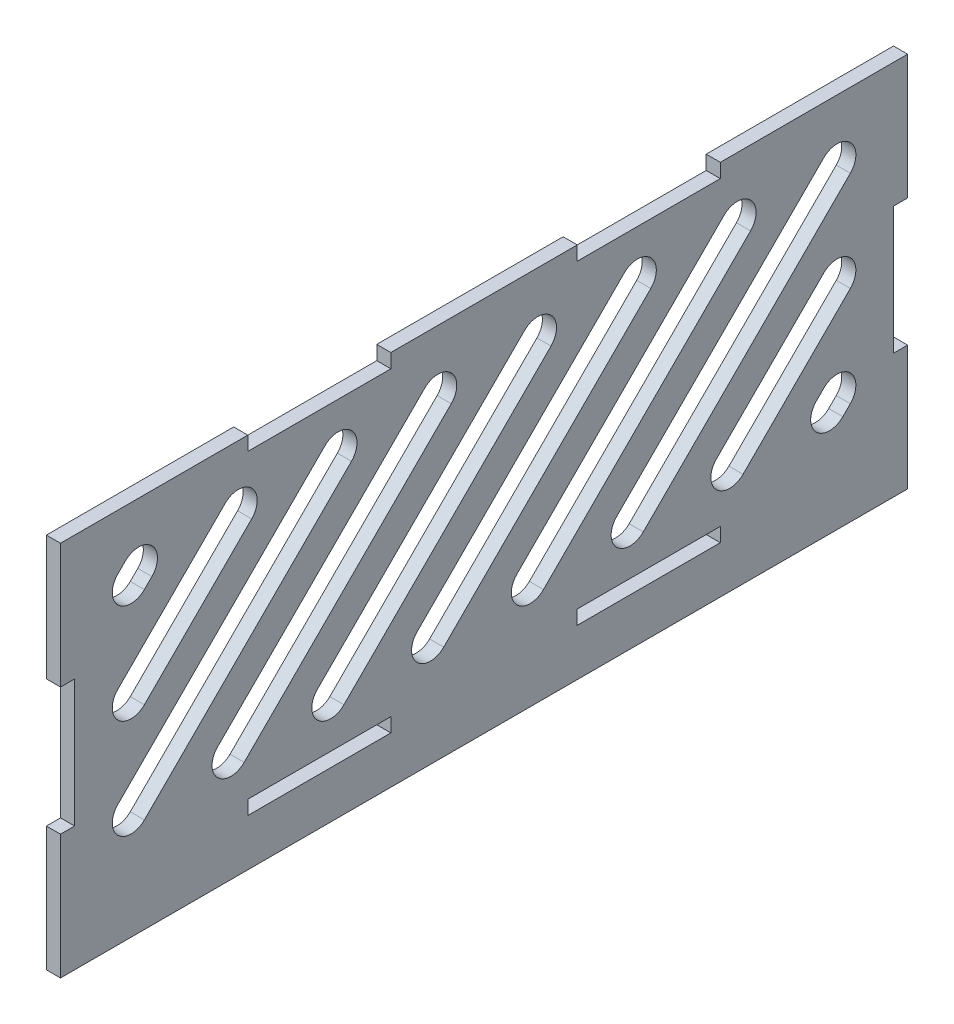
ISO-10303-21;
HEADER;
FILE_DESCRIPTION(('STEP AP214'),'2;1');
FILE_NAME('part.step','',(''),(''),'','','');
FILE_SCHEMA(('AUTOMOTIVE_DESIGN { 1 0 10303 214 1 1 1 1 }'));
ENDSEC;
DATA;
#1=APPLICATION_CONTEXT('core data for automotive mechanical design processes');
#2=APPLICATION_PROTOCOL_DEFINITION('international standard','automotive_design',2000,#1);
#3=PRODUCT_CONTEXT('',#1,'mechanical');
#4=PRODUCT('Part','Part','',(#3));
#5=PRODUCT_RELATED_PRODUCT_CATEGORY('part','',(#4));
#6=PRODUCT_DEFINITION_FORMATION('','',#4);
#7=PRODUCT_DEFINITION_CONTEXT('part definition',#1,'design');
#8=PRODUCT_DEFINITION('design','',#6,#7);
#9=PRODUCT_DEFINITION_SHAPE('','',#8);
#10=(LENGTH_UNIT() NAMED_UNIT(*) SI_UNIT(.MILLI.,.METRE.));
#11=(NAMED_UNIT(*) PLANE_ANGLE_UNIT() SI_UNIT($,.RADIAN.));
#12=(NAMED_UNIT(*) SI_UNIT($,.STERADIAN.) SOLID_ANGLE_UNIT());
#13=UNCERTAINTY_MEASURE_WITH_UNIT(LENGTH_MEASURE(1.E-05),#10,'distance_accuracy_value','');
#14=(GEOMETRIC_REPRESENTATION_CONTEXT(3) GLOBAL_UNCERTAINTY_ASSIGNED_CONTEXT((#13)) GLOBAL_UNIT_ASSIGNED_CONTEXT((#10,
#11,#12)) REPRESENTATION_CONTEXT('',''));
#15=CARTESIAN_POINT('',(0.,0.,0.));
#16=DIRECTION('',(0.,0.,1.));
#17=DIRECTION('',(1.,0.,0.));
#18=AXIS2_PLACEMENT_3D('',#15,#16,#17);
#19=CARTESIAN_POINT('',(-7.,-17.,-31.));
#20=DIRECTION('',(1.,0.,0.));
#21=DIRECTION('',(0.,0.,-1.));
#22=AXIS2_PLACEMENT_3D('',#19,#20,#21);
#23=CYLINDRICAL_SURFACE('',#22,3.99999999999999);
#24=CARTESIAN_POINT('',(0.,-17.,-31.));
#25=DIRECTION('',(-1.,0.,0.));
#26=DIRECTION('',(0.,0.,1.));
#27=AXIS2_PLACEMENT_3D('',#24,#25,#26);
#28=CIRCLE('',#27,3.99999999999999);
#29=CARTESIAN_POINT('',(0.,-19.8284271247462,-33.8284271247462));
#30=VERTEX_POINT('',#29);
#31=CARTESIAN_POINT('',(0.,-14.1715728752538,-28.1715728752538));
#32=VERTEX_POINT('',#31);
#33=EDGE_CURVE('E986',#30,#32,#28,.T.);
#34=ORIENTED_EDGE('',*,*,#33,.T.);
#35=DIRECTION('',(1.,0.,0.));
#36=VECTOR('',#35,1.);
#37=CARTESIAN_POINT('',(-7.,-14.1715728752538,-28.1715728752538));
#38=LINE('',#37,#36);
#39=CARTESIAN_POINT('',(3.,-14.1715728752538,-28.1715728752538));
#40=VERTEX_POINT('',#39);
#41=EDGE_CURVE('E1007',#32,#40,#38,.T.);
#42=ORIENTED_EDGE('',*,*,#41,.T.);
#43=CARTESIAN_POINT('',(3.,-17.,-31.));
#44=DIRECTION('',(1.,0.,0.));
#45=DIRECTION('',(0.,0.,-1.));
#46=AXIS2_PLACEMENT_3D('',#43,#44,#45);
#47=CIRCLE('',#46,3.99999999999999);
#48=CARTESIAN_POINT('',(3.,-19.8284271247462,-33.8284271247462));
#49=VERTEX_POINT('',#48);
#50=EDGE_CURVE('E1001',#40,#49,#47,.T.);
#51=ORIENTED_EDGE('',*,*,#50,.T.);
#52=DIRECTION('',(1.,0.,0.));
#53=VECTOR('',#52,1.);
#54=CARTESIAN_POINT('',(-7.,-19.8284271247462,-33.8284271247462));
#55=LINE('',#54,#53);
#56=EDGE_CURVE('E1013',#30,#49,#55,.T.);
#57=ORIENTED_EDGE('',*,*,#56,.F.);
#58=EDGE_LOOP('',(#34,#42,#51,#57));
#59=FACE_BOUND('',#58,.T.);
#60=ADVANCED_FACE('F131',(#59),#23,.F.);
#61=CARTESIAN_POINT('',(-7.,26.1715728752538,-79.8284271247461));
#62=DIRECTION('',(0.,0.707106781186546,0.707106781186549));
#63=DIRECTION('',(0.,-0.707106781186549,0.707106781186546));
#64=AXIS2_PLACEMENT_3D('',#61,#62,#63);
#65=PLANE('',#64);
#66=ORIENTED_EDGE('',*,*,#56,.T.);
#67=DIRECTION('',(0.,-0.707106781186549,0.707106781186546));
#68=VECTOR('',#67,1.);
#69=CARTESIAN_POINT('',(3.,26.1715728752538,-79.8284271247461));
#70=LINE('',#69,#68);
#71=CARTESIAN_POINT('',(3.,24.1715728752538,-77.828427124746));
#72=VERTEX_POINT('',#71);
#73=EDGE_CURVE('E999',#72,#49,#70,.T.);
#74=ORIENTED_EDGE('',*,*,#73,.F.);
#75=DIRECTION('',(1.,0.,0.));
#76=VECTOR('',#75,1.);
#77=CARTESIAN_POINT('',(-7.,24.1715728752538,-77.828427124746));
#78=LINE('',#77,#76);
#79=CARTESIAN_POINT('',(0.,24.1715728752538,-77.828427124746));
#80=VERTEX_POINT('',#79);
#81=EDGE_CURVE('E1010',#80,#72,#78,.T.);
#82=ORIENTED_EDGE('',*,*,#81,.F.);
#83=DIRECTION('',(0.,0.707106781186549,-0.707106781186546));
#84=VECTOR('',#83,1.);
#85=CARTESIAN_POINT('',(0.,26.1715728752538,-79.8284271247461));
#86=LINE('',#85,#84);
#87=EDGE_CURVE('E989',#30,#80,#86,.T.);
#88=ORIENTED_EDGE('',*,*,#87,.F.);
#89=EDGE_LOOP('',(#66,#74,#82,#88));
#90=FACE_BOUND('',#89,.T.);
#91=ADVANCED_FACE('F1113',(#90),#65,.T.);
#92=CARTESIAN_POINT('',(-7.,27.,-74.9999999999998));
#93=DIRECTION('',(1.,0.,0.));
#94=DIRECTION('',(0.,0.,-1.));
#95=AXIS2_PLACEMENT_3D('',#92,#93,#94);
#96=CYLINDRICAL_SURFACE('',#95,4.);
#97=CARTESIAN_POINT('',(0.,27.,-74.9999999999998));
#98=DIRECTION('',(-1.,0.,0.));
#99=DIRECTION('',(0.,0.,1.));
#100=AXIS2_PLACEMENT_3D('',#97,#98,#99);
#101=CIRCLE('',#100,4.);
#102=CARTESIAN_POINT('',(0.,29.8284271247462,-72.1715728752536));
#103=VERTEX_POINT('',#102);
#104=EDGE_CURVE('E991',#103,#80,#101,.T.);
#105=ORIENTED_EDGE('',*,*,#104,.T.);
#106=ORIENTED_EDGE('',*,*,#81,.T.);
#107=CARTESIAN_POINT('',(3.,27.,-74.9999999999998));
#108=DIRECTION('',(1.,0.,0.));
#109=DIRECTION('',(0.,0.,-1.));
#110=AXIS2_PLACEMENT_3D('',#107,#108,#109);
#111=CIRCLE('',#110,4.);
#112=CARTESIAN_POINT('',(3.,29.8284271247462,-72.1715728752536));
#113=VERTEX_POINT('',#112);
#114=EDGE_CURVE('E996',#72,#113,#111,.T.);
#115=ORIENTED_EDGE('',*,*,#114,.T.);
#116=DIRECTION('',(1.,0.,0.));
#117=VECTOR('',#116,1.);
#118=CARTESIAN_POINT('',(-7.,29.8284271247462,-72.1715728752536));
#119=LINE('',#118,#117);
#120=EDGE_CURVE('E1004',#103,#113,#119,.T.);
#121=ORIENTED_EDGE('',*,*,#120,.F.);
#122=EDGE_LOOP('',(#105,#106,#115,#121));
#123=FACE_BOUND('',#122,.T.);
#124=ADVANCED_FACE('F1119',(#123),#96,.F.);
#125=CARTESIAN_POINT('',(-7.,31.8284271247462,-74.1715728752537));
#126=DIRECTION('',(0.,0.707106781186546,0.707106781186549));
#127=DIRECTION('',(0.,-0.707106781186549,0.707106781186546));
#128=AXIS2_PLACEMENT_3D('',#125,#126,#127);
#129=PLANE('',#128);
#130=DIRECTION('',(0.,0.707106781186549,-0.707106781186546));
#131=VECTOR('',#130,1.);
#132=CARTESIAN_POINT('',(0.,31.8284271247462,-74.1715728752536));
#133=LINE('',#132,#131);
#134=EDGE_CURVE('E984',#32,#103,#133,.T.);
#135=ORIENTED_EDGE('',*,*,#134,.T.);
#136=ORIENTED_EDGE('',*,*,#120,.T.);
#137=DIRECTION('',(0.,-0.707106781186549,0.707106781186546));
#138=VECTOR('',#137,1.);
#139=CARTESIAN_POINT('',(3.,31.8284271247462,-74.1715728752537));
#140=LINE('',#139,#138);
#141=EDGE_CURVE('E994',#113,#40,#140,.T.);
#142=ORIENTED_EDGE('',*,*,#141,.T.);
#143=ORIENTED_EDGE('',*,*,#41,.F.);
#144=EDGE_LOOP('',(#135,#136,#142,#143));
#145=FACE_BOUND('',#144,.T.);
#146=ADVANCED_FACE('F1126',(#145),#129,.F.);
#147=CARTESIAN_POINT('',(-7.,-17.,-9.80000000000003));
#148=DIRECTION('',(1.,0.,0.));
#149=DIRECTION('',(0.,0.,-1.));
#150=AXIS2_PLACEMENT_3D('',#147,#148,#149);
#151=CYLINDRICAL_SURFACE('',#150,3.99999999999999);
#152=CARTESIAN_POINT('',(0.,-17.,-9.80000000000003));
#153=DIRECTION('',(-1.,0.,0.));
#154=DIRECTION('',(0.,0.,1.));
#155=AXIS2_PLACEMENT_3D('',#152,#153,#154);
#156=CIRCLE('',#155,3.99999999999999);
#157=CARTESIAN_POINT('',(0.,-19.8284271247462,-12.6284271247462));
#158=VERTEX_POINT('',#157);
#159=CARTESIAN_POINT('',(0.,-14.1715728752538,-6.97157287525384));
#160=VERTEX_POINT('',#159);
#161=EDGE_CURVE('E954',#158,#160,#156,.T.);
#162=ORIENTED_EDGE('',*,*,#161,.T.);
#163=DIRECTION('',(1.,0.,0.));
#164=VECTOR('',#163,1.);
#165=CARTESIAN_POINT('',(-7.,-14.1715728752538,-6.97157287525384));
#166=LINE('',#165,#164);
#167=CARTESIAN_POINT('',(3.,-14.1715728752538,-6.97157287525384));
#168=VERTEX_POINT('',#167);
#169=EDGE_CURVE('E975',#160,#168,#166,.T.);
#170=ORIENTED_EDGE('',*,*,#169,.T.);
#171=CARTESIAN_POINT('',(3.,-17.,-9.80000000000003));
#172=DIRECTION('',(1.,0.,0.));
#173=DIRECTION('',(0.,0.,-1.));
#174=AXIS2_PLACEMENT_3D('',#171,#172,#173);
#175=CIRCLE('',#174,3.99999999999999);
#176=CARTESIAN_POINT('',(3.,-19.8284271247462,-12.6284271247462));
#177=VERTEX_POINT('',#176);
#178=EDGE_CURVE('E969',#168,#177,#175,.T.);
#179=ORIENTED_EDGE('',*,*,#178,.T.);
#180=DIRECTION('',(1.,0.,0.));
#181=VECTOR('',#180,1.);
#182=CARTESIAN_POINT('',(-7.,-19.8284271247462,-12.6284271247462));
#183=LINE('',#182,#181);
#184=EDGE_CURVE('E981',#158,#177,#183,.T.);
#185=ORIENTED_EDGE('',*,*,#184,.F.);
#186=EDGE_LOOP('',(#162,#170,#179,#185));
#187=FACE_BOUND('',#186,.T.);
#188=ADVANCED_FACE('F1139',(#187),#151,.F.);
#189=CARTESIAN_POINT('',(-7.,26.1715728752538,-58.6284271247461));
#190=DIRECTION('',(0.,0.707106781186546,0.707106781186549));
#191=DIRECTION('',(0.,-0.707106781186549,0.707106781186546));
#192=AXIS2_PLACEMENT_3D('',#189,#190,#191);
#193=PLANE('',#192);
#194=ORIENTED_EDGE('',*,*,#184,.T.);
#195=DIRECTION('',(0.,-0.707106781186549,0.707106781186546));
#196=VECTOR('',#195,1.);
#197=CARTESIAN_POINT('',(3.,26.1715728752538,-58.6284271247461));
#198=LINE('',#197,#196);
#199=CARTESIAN_POINT('',(3.,24.1715728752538,-56.628427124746));
#200=VERTEX_POINT('',#199);
#201=EDGE_CURVE('E967',#200,#177,#198,.T.);
#202=ORIENTED_EDGE('',*,*,#201,.F.);
#203=DIRECTION('',(1.,0.,0.));
#204=VECTOR('',#203,1.);
#205=CARTESIAN_POINT('',(-7.,24.1715728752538,-56.628427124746));
#206=LINE('',#205,#204);
#207=CARTESIAN_POINT('',(0.,24.1715728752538,-56.628427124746));
#208=VERTEX_POINT('',#207);
#209=EDGE_CURVE('E978',#208,#200,#206,.T.);
#210=ORIENTED_EDGE('',*,*,#209,.F.);
#211=DIRECTION('',(0.,0.707106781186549,-0.707106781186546));
#212=VECTOR('',#211,1.);
#213=CARTESIAN_POINT('',(0.,26.1715728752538,-58.6284271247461));
#214=LINE('',#213,#212);
#215=EDGE_CURVE('E957',#158,#208,#214,.T.);
#216=ORIENTED_EDGE('',*,*,#215,.F.);
#217=EDGE_LOOP('',(#194,#202,#210,#216));
#218=FACE_BOUND('',#217,.T.);
#219=ADVANCED_FACE('F1144',(#218),#193,.T.);
#220=CARTESIAN_POINT('',(-7.,27.,-53.7999999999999));
#221=DIRECTION('',(1.,0.,0.));
#222=DIRECTION('',(0.,0.,-1.));
#223=AXIS2_PLACEMENT_3D('',#220,#221,#222);
#224=CYLINDRICAL_SURFACE('',#223,4.);
#225=CARTESIAN_POINT('',(0.,27.,-53.7999999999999));
#226=DIRECTION('',(-1.,0.,0.));
#227=DIRECTION('',(0.,0.,1.));
#228=AXIS2_PLACEMENT_3D('',#225,#226,#227);
#229=CIRCLE('',#228,4.);
#230=CARTESIAN_POINT('',(0.,29.8284271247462,-50.9715728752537));
#231=VERTEX_POINT('',#230);
#232=EDGE_CURVE('E959',#231,#208,#229,.T.);
#233=ORIENTED_EDGE('',*,*,#232,.T.);
#234=ORIENTED_EDGE('',*,*,#209,.T.);
#235=CARTESIAN_POINT('',(3.,27.,-53.7999999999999));
#236=DIRECTION('',(1.,0.,0.));
#237=DIRECTION('',(0.,0.,-1.));
#238=AXIS2_PLACEMENT_3D('',#235,#236,#237);
#239=CIRCLE('',#238,4.);
#240=CARTESIAN_POINT('',(3.,29.8284271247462,-50.9715728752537));
#241=VERTEX_POINT('',#240);
#242=EDGE_CURVE('E964',#200,#241,#239,.T.);
#243=ORIENTED_EDGE('',*,*,#242,.T.);
#244=DIRECTION('',(1.,0.,0.));
#245=VECTOR('',#244,1.);
#246=CARTESIAN_POINT('',(-7.,29.8284271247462,-50.9715728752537));
#247=LINE('',#246,#245);
#248=EDGE_CURVE('E972',#231,#241,#247,.T.);
#249=ORIENTED_EDGE('',*,*,#248,.F.);
#250=EDGE_LOOP('',(#233,#234,#243,#249));
#251=FACE_BOUND('',#250,.T.);
#252=ADVANCED_FACE('F1148',(#251),#224,.F.);
#253=CARTESIAN_POINT('',(-7.,31.8284271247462,-52.9715728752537));
#254=DIRECTION('',(0.,0.707106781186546,0.707106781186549));
#255=DIRECTION('',(0.,-0.707106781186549,0.707106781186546));
#256=AXIS2_PLACEMENT_3D('',#253,#254,#255);
#257=PLANE('',#256);
#258=DIRECTION('',(0.,0.707106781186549,-0.707106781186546));
#259=VECTOR('',#258,1.);
#260=CARTESIAN_POINT('',(0.,31.8284271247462,-52.9715728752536));
#261=LINE('',#260,#259);
#262=EDGE_CURVE('E952',#160,#231,#261,.T.);
#263=ORIENTED_EDGE('',*,*,#262,.T.);
#264=ORIENTED_EDGE('',*,*,#248,.T.);
#265=DIRECTION('',(0.,-0.707106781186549,0.707106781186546));
#266=VECTOR('',#265,1.);
#267=CARTESIAN_POINT('',(3.,31.8284271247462,-52.9715728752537));
#268=LINE('',#267,#266);
#269=EDGE_CURVE('E962',#241,#168,#268,.T.);
#270=ORIENTED_EDGE('',*,*,#269,.T.);
#271=ORIENTED_EDGE('',*,*,#169,.F.);
#272=EDGE_LOOP('',(#263,#264,#270,#271));
#273=FACE_BOUND('',#272,.T.);
#274=ADVANCED_FACE('F1085',(#273),#257,.F.);
#275=CARTESIAN_POINT('',(3.,0.,0.));
#276=DIRECTION('',(-1.,0.,0.));
#277=DIRECTION('',(0.,0.,1.));
#278=AXIS2_PLACEMENT_3D('',#275,#276,#277);
#279=PLANE('',#278);
#280=DIRECTION('',(0.,0.707106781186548,-0.707106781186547));
#281=VECTOR('',#280,1.);
#282=CARTESIAN_POINT('',(3.,-19.8284271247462,-55.0284271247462));
#283=LINE('',#282,#281);
#284=CARTESIAN_POINT('',(3.,-19.8284271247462,-55.0284271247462));
#285=VERTEX_POINT('',#284);
#286=CARTESIAN_POINT('',(3.,2.97157287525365,-77.828427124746));
#287=VERTEX_POINT('',#286);
#288=EDGE_CURVE('E592',#285,#287,#283,.T.);
#289=ORIENTED_EDGE('',*,*,#288,.F.);
#290=CARTESIAN_POINT('',(3.,-17.,-52.2));
#291=DIRECTION('',(1.,0.,0.));
#292=DIRECTION('',(0.,0.,-1.));
#293=AXIS2_PLACEMENT_3D('',#290,#291,#292);
#294=CIRCLE('',#293,4.00000000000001);
#295=CARTESIAN_POINT('',(3.,-14.1715728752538,-49.3715728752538));
#296=VERTEX_POINT('',#295);
#297=EDGE_CURVE('E145',#296,#285,#294,.T.);
#298=ORIENTED_EDGE('',*,*,#297,.F.);
#299=DIRECTION('',(0.,-0.707106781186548,0.707106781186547));
#300=VECTOR('',#299,1.);
#301=CARTESIAN_POINT('',(3.,-14.1715728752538,-49.3715728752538));
#302=LINE('',#301,#300);
#303=CARTESIAN_POINT('',(3.,8.62842712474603,-72.1715728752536));
#304=VERTEX_POINT('',#303);
#305=EDGE_CURVE('E599',#304,#296,#302,.T.);
#306=ORIENTED_EDGE('',*,*,#305,.F.);
#307=CARTESIAN_POINT('',(3.,5.79999999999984,-74.9999999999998));
#308=DIRECTION('',(1.,0.,0.));
#309=DIRECTION('',(0.,0.,-1.));
#310=AXIS2_PLACEMENT_3D('',#307,#308,#309);
#311=CIRCLE('',#310,4.);
#312=EDGE_CURVE('E596',#287,#304,#311,.T.);
#313=ORIENTED_EDGE('',*,*,#312,.F.);
#314=EDGE_LOOP('',(#289,#298,#306,#313));
#315=FACE_BOUND('',#314,.T.);
#316=DIRECTION('',(0.,-0.707106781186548,0.707106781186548));
#317=VECTOR('',#316,1.);
#318=CARTESIAN_POINT('',(3.,29.8284271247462,76.2284271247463));
#319=LINE('',#318,#317);
#320=CARTESIAN_POINT('',(3.,29.8284271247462,76.2284271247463));
#321=VERTEX_POINT('',#320);
#322=CARTESIAN_POINT('',(3.,28.2284271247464,77.8284271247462));
#323=VERTEX_POINT('',#322);
#324=EDGE_CURVE('E612',#321,#323,#319,.T.);
#325=ORIENTED_EDGE('',*,*,#324,.F.);
#326=CARTESIAN_POINT('',(3.,27.,73.4000000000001));
#327=DIRECTION('',(1.,0.,0.));
#328=DIRECTION('',(0.,0.,-1.));
#329=AXIS2_PLACEMENT_3D('',#326,#327,#328);
#330=CIRCLE('',#329,4.);
#331=CARTESIAN_POINT('',(3.,24.1715728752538,70.5715728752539));
#332=VERTEX_POINT('',#331);
#333=EDGE_CURVE('E153',#332,#321,#330,.T.);
#334=ORIENTED_EDGE('',*,*,#333,.F.);
#335=DIRECTION('',(0.,0.707106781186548,-0.707106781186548));
#336=VECTOR('',#335,1.);
#337=CARTESIAN_POINT('',(3.,24.1715728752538,70.5715728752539));
#338=LINE('',#337,#336);
#339=CARTESIAN_POINT('',(3.,22.571572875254,72.1715728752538));
#340=VERTEX_POINT('',#339);
#341=EDGE_CURVE('E618',#340,#332,#338,.T.);
#342=ORIENTED_EDGE('',*,*,#341,.F.);
#343=CARTESIAN_POINT('',(3.,25.4000000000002,75.));
#344=DIRECTION('',(1.,0.,0.));
#345=DIRECTION('',(0.,0.,-1.));
#346=AXIS2_PLACEMENT_3D('',#343,#344,#345);
#347=CIRCLE('',#346,4.);
#348=EDGE_CURVE('E615',#323,#340,#347,.T.);
#349=ORIENTED_EDGE('',*,*,#348,.F.);
#350=EDGE_LOOP('',(#325,#334,#342,#349));
#351=FACE_BOUND('',#350,.T.);
#352=DIRECTION('',(0.,0.707106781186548,-0.707106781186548));
#353=VECTOR('',#352,1.);
#354=CARTESIAN_POINT('',(3.,-19.8284271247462,-76.2284271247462));
#355=LINE('',#354,#353);
#356=CARTESIAN_POINT('',(3.,-19.8284271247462,-76.2284271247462));
#357=VERTEX_POINT('',#356);
#358=CARTESIAN_POINT('',(3.,-18.2284271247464,-77.828427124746));
#359=VERTEX_POINT('',#358);
#360=EDGE_CURVE('E572',#357,#359,#355,.T.);
#361=ORIENTED_EDGE('',*,*,#360,.F.);
#362=CARTESIAN_POINT('',(3.,-17.,-73.4));
#363=DIRECTION('',(1.,0.,0.));
#364=DIRECTION('',(0.,0.,-1.));
#365=AXIS2_PLACEMENT_3D('',#362,#363,#364);
#366=CIRCLE('',#365,4.);
#367=CARTESIAN_POINT('',(3.,-14.1715728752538,-70.5715728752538));
#368=VERTEX_POINT('',#367);
#369=EDGE_CURVE('E577',#368,#357,#366,.T.);
#370=ORIENTED_EDGE('',*,*,#369,.F.);
#371=DIRECTION('',(0.,-0.707106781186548,0.707106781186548));
#372=VECTOR('',#371,1.);
#373=CARTESIAN_POINT('',(3.,-14.1715728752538,-70.5715728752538));
#374=LINE('',#373,#372);
#375=CARTESIAN_POINT('',(3.,-12.571572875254,-72.1715728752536));
#376=VERTEX_POINT('',#375);
#377=EDGE_CURVE('E582',#376,#368,#374,.T.);
#378=ORIENTED_EDGE('',*,*,#377,.F.);
#379=CARTESIAN_POINT('',(3.,-15.4000000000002,-74.9999999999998));
#380=DIRECTION('',(1.,0.,0.));
#381=DIRECTION('',(0.,0.,-1.));
#382=AXIS2_PLACEMENT_3D('',#379,#380,#381);
#383=CIRCLE('',#382,4.);
#384=EDGE_CURVE('E561',#359,#376,#383,.T.);
#385=ORIENTED_EDGE('',*,*,#384,.F.);
#386=EDGE_LOOP('',(#361,#370,#378,#385));
#387=FACE_BOUND('',#386,.T.);
#388=DIRECTION('',(0.,-0.707106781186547,0.707106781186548));
#389=VECTOR('',#388,1.);
#390=CARTESIAN_POINT('',(3.,29.8284271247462,55.0284271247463));
#391=LINE('',#390,#389);
#392=CARTESIAN_POINT('',(3.,29.8284271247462,55.0284271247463));
#393=VERTEX_POINT('',#392);
#394=CARTESIAN_POINT('',(3.,7.02842712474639,77.8284271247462));
#395=VERTEX_POINT('',#394);
#396=EDGE_CURVE('E629',#393,#395,#391,.T.);
#397=ORIENTED_EDGE('',*,*,#396,.F.);
#398=CARTESIAN_POINT('',(3.,27.,52.2000000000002));
#399=DIRECTION('',(1.,0.,0.));
#400=DIRECTION('',(0.,0.,-1.));
#401=AXIS2_PLACEMENT_3D('',#398,#399,#400);
#402=CIRCLE('',#401,4.);
#403=CARTESIAN_POINT('',(3.,24.1715728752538,49.371572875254));
#404=VERTEX_POINT('',#403);
#405=EDGE_CURVE('E605',#404,#393,#402,.T.);
#406=ORIENTED_EDGE('',*,*,#405,.F.);
#407=DIRECTION('',(0.,0.707106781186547,-0.707106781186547));
#408=VECTOR('',#407,1.);
#409=CARTESIAN_POINT('',(3.,24.1715728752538,49.371572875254));
#410=LINE('',#409,#408);
#411=CARTESIAN_POINT('',(3.,1.371572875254,72.1715728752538));
#412=VERTEX_POINT('',#411);
#413=EDGE_CURVE('E635',#412,#404,#410,.T.);
#414=ORIENTED_EDGE('',*,*,#413,.F.);
#415=CARTESIAN_POINT('',(3.,4.2000000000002,75.));
#416=DIRECTION('',(1.,0.,0.));
#417=DIRECTION('',(0.,0.,-1.));
#418=AXIS2_PLACEMENT_3D('',#415,#416,#417);
#419=CIRCLE('',#418,4.);
#420=EDGE_CURVE('E632',#395,#412,#419,.T.);
#421=ORIENTED_EDGE('',*,*,#420,.F.);
#422=EDGE_LOOP('',(#397,#406,#414,#421));
#423=FACE_BOUND('',#422,.T.);
#424=CARTESIAN_POINT('',(3.,-17.,32.6));
#425=DIRECTION('',(1.,0.,0.));
#426=DIRECTION('',(0.,0.,-1.));
#427=AXIS2_PLACEMENT_3D('',#424,#425,#426);
#428=CIRCLE('',#427,3.99999999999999);
#429=CARTESIAN_POINT('',(3.,-14.1715728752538,35.4284271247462));
#430=VERTEX_POINT('',#429);
#431=CARTESIAN_POINT('',(3.,-19.8284271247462,29.7715728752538));
#432=VERTEX_POINT('',#431);
#433=EDGE_CURVE('E649',#430,#432,#428,.T.);
#434=ORIENTED_EDGE('',*,*,#433,.F.);
#435=DIRECTION('',(0.,-0.707106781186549,0.707106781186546));
#436=VECTOR('',#435,1.);
#437=CARTESIAN_POINT('',(3.,31.8284271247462,-10.5715728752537));
#438=LINE('',#437,#436);
#439=CARTESIAN_POINT('',(3.,29.8284271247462,-8.57157287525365));
#440=VERTEX_POINT('',#439);
#441=EDGE_CURVE('E641',#440,#430,#438,.T.);
#442=ORIENTED_EDGE('',*,*,#441,.F.);
#443=CARTESIAN_POINT('',(3.,27.,-11.3999999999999));
#444=DIRECTION('',(1.,0.,0.));
#445=DIRECTION('',(0.,0.,-1.));
#446=AXIS2_PLACEMENT_3D('',#443,#444,#445);
#447=CIRCLE('',#446,4.);
#448=CARTESIAN_POINT('',(3.,24.1715728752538,-14.228427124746));
#449=VERTEX_POINT('',#448);
#450=EDGE_CURVE('E655',#449,#440,#447,.T.);
#451=ORIENTED_EDGE('',*,*,#450,.F.);
#452=DIRECTION('',(0.,-0.707106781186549,0.707106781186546));
#453=VECTOR('',#452,1.);
#454=CARTESIAN_POINT('',(3.,26.1715728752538,-16.2284271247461));
#455=LINE('',#454,#453);
#456=EDGE_CURVE('E652',#449,#432,#455,.T.);
#457=ORIENTED_EDGE('',*,*,#456,.T.);
#458=EDGE_LOOP('',(#434,#442,#451,#457));
#459=FACE_BOUND('',#458,.T.);
#460=CARTESIAN_POINT('',(3.,-17.,53.8));
#461=DIRECTION('',(1.,0.,0.));
#462=DIRECTION('',(0.,0.,-1.));
#463=AXIS2_PLACEMENT_3D('',#460,#461,#462);
#464=CIRCLE('',#463,3.99999999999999);
#465=CARTESIAN_POINT('',(3.,-14.1715728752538,56.6284271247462));
#466=VERTEX_POINT('',#465);
#467=CARTESIAN_POINT('',(3.,-19.8284271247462,50.9715728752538));
#468=VERTEX_POINT('',#467);
#469=EDGE_CURVE('E669',#466,#468,#464,.T.);
#470=ORIENTED_EDGE('',*,*,#469,.F.);
#471=DIRECTION('',(0.,-0.707106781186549,0.707106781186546));
#472=VECTOR('',#471,1.);
#473=CARTESIAN_POINT('',(3.,31.8284271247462,10.6284271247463));
#474=LINE('',#473,#472);
#475=CARTESIAN_POINT('',(3.,29.8284271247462,12.6284271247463));
#476=VERTEX_POINT('',#475);
#477=EDGE_CURVE('E661',#476,#466,#474,.T.);
#478=ORIENTED_EDGE('',*,*,#477,.F.);
#479=CARTESIAN_POINT('',(3.,27.,9.80000000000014));
#480=DIRECTION('',(1.,0.,0.));
#481=DIRECTION('',(0.,0.,-1.));
#482=AXIS2_PLACEMENT_3D('',#479,#480,#481);
#483=CIRCLE('',#482,4.);
#484=CARTESIAN_POINT('',(3.,24.1715728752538,6.97157287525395));
#485=VERTEX_POINT('',#484);
#486=EDGE_CURVE('E675',#485,#476,#483,.T.);
#487=ORIENTED_EDGE('',*,*,#486,.F.);
#488=DIRECTION('',(0.,-0.707106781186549,0.707106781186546));
#489=VECTOR('',#488,1.);
#490=CARTESIAN_POINT('',(3.,26.1715728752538,4.97157287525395));
#491=LINE('',#490,#489);
#492=EDGE_CURVE('E672',#485,#468,#491,.T.);
#493=ORIENTED_EDGE('',*,*,#492,.T.);
#494=EDGE_LOOP('',(#470,#478,#487,#493));
#495=FACE_BOUND('',#494,.T.);
#496=CARTESIAN_POINT('',(3.,-17.,11.4));
#497=DIRECTION('',(1.,0.,0.));
#498=DIRECTION('',(0.,0.,-1.));
#499=AXIS2_PLACEMENT_3D('',#496,#497,#498);
#500=CIRCLE('',#499,3.99999999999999);
#501=CARTESIAN_POINT('',(3.,-14.1715728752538,14.2284271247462));
#502=VERTEX_POINT('',#501);
#503=CARTESIAN_POINT('',(3.,-19.8284271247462,8.57157287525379));
#504=VERTEX_POINT('',#503);
#505=EDGE_CURVE('E689',#502,#504,#500,.T.);
#506=ORIENTED_EDGE('',*,*,#505,.F.);
#507=DIRECTION('',(0.,-0.707106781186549,0.707106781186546));
#508=VECTOR('',#507,1.);
#509=CARTESIAN_POINT('',(3.,31.8284271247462,-31.7715728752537));
#510=LINE('',#509,#508);
#511=CARTESIAN_POINT('',(3.,29.8284271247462,-29.7715728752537));
#512=VERTEX_POINT('',#511);
#513=EDGE_CURVE('E717',#512,#502,#510,.T.);
#514=ORIENTED_EDGE('',*,*,#513,.F.);
#515=CARTESIAN_POINT('',(3.,27.,-32.5999999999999));
#516=DIRECTION('',(1.,0.,0.));
#517=DIRECTION('',(0.,0.,-1.));
#518=AXIS2_PLACEMENT_3D('',#515,#516,#517);
#519=CIRCLE('',#518,4.);
#520=CARTESIAN_POINT('',(3.,24.1715728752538,-35.428427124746));
#521=VERTEX_POINT('',#520);
#522=EDGE_CURVE('E709',#521,#512,#519,.T.);
#523=ORIENTED_EDGE('',*,*,#522,.F.);
#524=DIRECTION('',(0.,-0.707106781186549,0.707106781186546));
#525=VECTOR('',#524,1.);
#526=CARTESIAN_POINT('',(3.,26.1715728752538,-37.4284271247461));
#527=LINE('',#526,#525);
#528=EDGE_CURVE('E697',#521,#504,#527,.T.);
#529=ORIENTED_EDGE('',*,*,#528,.T.);
#530=EDGE_LOOP('',(#506,#514,#523,#529));
#531=FACE_BOUND('',#530,.T.);
#532=CARTESIAN_POINT('',(3.,-17.,75.));
#533=DIRECTION('',(1.,0.,0.));
#534=DIRECTION('',(0.,0.,-1.));
#535=AXIS2_PLACEMENT_3D('',#532,#533,#534);
#536=CIRCLE('',#535,3.99999999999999);
#537=CARTESIAN_POINT('',(3.,-14.1715728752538,77.8284271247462));
#538=VERTEX_POINT('',#537);
#539=CARTESIAN_POINT('',(3.,-19.8284271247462,72.1715728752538));
#540=VERTEX_POINT('',#539);
#541=EDGE_CURVE('E721',#538,#540,#536,.T.);
#542=ORIENTED_EDGE('',*,*,#541,.F.);
#543=DIRECTION('',(0.,-0.707106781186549,0.707106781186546));
#544=VECTOR('',#543,1.);
#545=CARTESIAN_POINT('',(3.,31.8284271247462,31.8284271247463));
#546=LINE('',#545,#544);
#547=CARTESIAN_POINT('',(3.,29.8284271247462,33.8284271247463));
#548=VERTEX_POINT('',#547);
#549=EDGE_CURVE('E719',#548,#538,#546,.T.);
#550=ORIENTED_EDGE('',*,*,#549,.F.);
#551=CARTESIAN_POINT('',(3.,27.,31.0000000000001));
#552=DIRECTION('',(1.,0.,0.));
#553=DIRECTION('',(0.,0.,-1.));
#554=AXIS2_PLACEMENT_3D('',#551,#552,#553);
#555=CIRCLE('',#554,4.);
#556=CARTESIAN_POINT('',(3.,24.1715728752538,28.171572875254));
#557=VERTEX_POINT('',#556);
#558=EDGE_CURVE('E727',#557,#548,#555,.T.);
#559=ORIENTED_EDGE('',*,*,#558,.F.);
#560=DIRECTION('',(0.,-0.707106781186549,0.707106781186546));
#561=VECTOR('',#560,1.);
#562=CARTESIAN_POINT('',(3.,26.1715728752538,26.1715728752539));
#563=LINE('',#562,#561);
#564=EDGE_CURVE('E724',#557,#540,#563,.T.);
#565=ORIENTED_EDGE('',*,*,#564,.T.);
#566=EDGE_LOOP('',(#542,#550,#559,#565));
#567=FACE_BOUND('',#566,.T.);
#568=DIRECTION('',(0.,-1.,0.));
#569=VECTOR('',#568,1.);
#570=CARTESIAN_POINT('',(3.,0.,50.2));
#571=LINE('',#570,#569);
#572=CARTESIAN_POINT('',(3.,-27.,50.2));
#573=VERTEX_POINT('',#572);
#574=CARTESIAN_POINT('',(3.,-30.,50.2));
#575=VERTEX_POINT('',#574);
#576=EDGE_CURVE('E896',#573,#575,#571,.T.);
#577=ORIENTED_EDGE('',*,*,#576,.F.);
#578=DIRECTION('',(0.,0.,1.));
#579=VECTOR('',#578,1.);
#580=CARTESIAN_POINT('',(3.,-27.,19.8));
#581=LINE('',#580,#579);
#582=CARTESIAN_POINT('',(3.,-27.,19.8));
#583=VERTEX_POINT('',#582);
#584=EDGE_CURVE('E876',#583,#573,#581,.T.);
#585=ORIENTED_EDGE('',*,*,#584,.F.);
#586=DIRECTION('',(0.,-1.,0.));
#587=VECTOR('',#586,1.);
#588=CARTESIAN_POINT('',(3.,0.,19.8));
#589=LINE('',#588,#587);
#590=CARTESIAN_POINT('',(3.,-30.,19.8));
#591=VERTEX_POINT('',#590);
#592=EDGE_CURVE('E886',#583,#591,#589,.T.);
#593=ORIENTED_EDGE('',*,*,#592,.T.);
#594=DIRECTION('',(0.,0.,1.));
#595=VECTOR('',#594,1.);
#596=CARTESIAN_POINT('',(3.,-30.,19.8));
#597=LINE('',#596,#595);
#598=EDGE_CURVE('E879',#591,#575,#597,.T.);
#599=ORIENTED_EDGE('',*,*,#598,.T.);
#600=EDGE_LOOP('',(#577,#585,#593,#599));
#601=FACE_BOUND('',#600,.T.);
#602=DIRECTION('',(0.,-1.,0.));
#603=VECTOR('',#602,1.);
#604=CARTESIAN_POINT('',(3.,0.,-19.8));
#605=LINE('',#604,#603);
#606=CARTESIAN_POINT('',(3.,-27.,-19.8));
#607=VERTEX_POINT('',#606);
#608=CARTESIAN_POINT('',(3.,-30.,-19.8));
#609=VERTEX_POINT('',#608);
#610=EDGE_CURVE('E841',#607,#609,#605,.T.);
#611=ORIENTED_EDGE('',*,*,#610,.F.);
#612=DIRECTION('',(0.,0.,1.));
#613=VECTOR('',#612,1.);
#614=CARTESIAN_POINT('',(3.,-27.,0.));
#615=LINE('',#614,#613);
#616=CARTESIAN_POINT('',(3.,-27.,-50.2));
#617=VERTEX_POINT('',#616);
#618=EDGE_CURVE('E843',#617,#607,#615,.T.);
#619=ORIENTED_EDGE('',*,*,#618,.F.);
#620=DIRECTION('',(0.,-1.,0.));
#621=VECTOR('',#620,1.);
#622=CARTESIAN_POINT('',(3.,0.,-50.2));
#623=LINE('',#622,#621);
#624=CARTESIAN_POINT('',(3.,-30.,-50.2));
#625=VERTEX_POINT('',#624);
#626=EDGE_CURVE('E846',#617,#625,#623,.T.);
#627=ORIENTED_EDGE('',*,*,#626,.T.);
#628=DIRECTION('',(0.,0.,1.));
#629=VECTOR('',#628,1.);
#630=CARTESIAN_POINT('',(3.,-30.,0.));
#631=LINE('',#630,#629);
#632=EDGE_CURVE('E849',#625,#609,#631,.T.);
#633=ORIENTED_EDGE('',*,*,#632,.T.);
#634=EDGE_LOOP('',(#611,#619,#627,#633));
#635=FACE_BOUND('',#634,.T.);
#636=DIRECTION('',(0.,-1.,0.));
#637=VECTOR('',#636,1.);
#638=CARTESIAN_POINT('',(3.,67.,-19.8));
#639=LINE('',#638,#637);
#640=CARTESIAN_POINT('',(3.,40.,-19.8));
#641=VERTEX_POINT('',#640);
#642=CARTESIAN_POINT('',(3.,37.,-19.8));
#643=VERTEX_POINT('',#642);
#644=EDGE_CURVE('E752',#641,#643,#639,.T.);
#645=ORIENTED_EDGE('',*,*,#644,.F.);
#646=DIRECTION('',(0.,0.,1.));
#647=VECTOR('',#646,1.);
#648=CARTESIAN_POINT('',(3.,40.,90.));
#649=LINE('',#648,#647);
#650=CARTESIAN_POINT('',(3.,40.,19.8));
#651=VERTEX_POINT('',#650);
#652=EDGE_CURVE('E911',#641,#651,#649,.T.);
#653=ORIENTED_EDGE('',*,*,#652,.T.);
#654=DIRECTION('',(0.,-1.,0.));
#655=VECTOR('',#654,1.);
#656=CARTESIAN_POINT('',(3.,67.,19.8));
#657=LINE('',#656,#655);
#658=CARTESIAN_POINT('',(3.,37.,19.8));
#659=VERTEX_POINT('',#658);
#660=EDGE_CURVE('E740',#651,#659,#657,.T.);
#661=ORIENTED_EDGE('',*,*,#660,.T.);
#662=DIRECTION('',(0.,0.,1.));
#663=VECTOR('',#662,1.);
#664=CARTESIAN_POINT('',(3.,37.,0.));
#665=LINE('',#664,#663);
#666=CARTESIAN_POINT('',(3.,37.,50.2));
#667=VERTEX_POINT('',#666);
#668=EDGE_CURVE('E778',#659,#667,#665,.T.);
#669=ORIENTED_EDGE('',*,*,#668,.T.);
#670=DIRECTION('',(0.,-1.,0.));
#671=VECTOR('',#670,1.);
#672=CARTESIAN_POINT('',(3.,67.,50.2));
#673=LINE('',#672,#671);
#674=CARTESIAN_POINT('',(3.,40.,50.2));
#675=VERTEX_POINT('',#674);
#676=EDGE_CURVE('E776',#675,#667,#673,.T.);
#677=ORIENTED_EDGE('',*,*,#676,.F.);
#678=CARTESIAN_POINT('',(3.,40.,90.));
#679=VERTEX_POINT('',#678);
#680=EDGE_CURVE('E905',#675,#679,#649,.T.);
#681=ORIENTED_EDGE('',*,*,#680,.T.);
#682=DIRECTION('',(0.,-1.,0.));
#683=VECTOR('',#682,1.);
#684=CARTESIAN_POINT('',(3.,-40.,90.));
#685=LINE('',#684,#683);
#686=CARTESIAN_POINT('',(3.,13.5333333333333,90.));
#687=VERTEX_POINT('',#686);
#688=EDGE_CURVE('E912',#679,#687,#685,.T.);
#689=ORIENTED_EDGE('',*,*,#688,.T.);
#690=DIRECTION('',(0.,0.,1.));
#691=VECTOR('',#690,1.);
#692=CARTESIAN_POINT('',(3.,13.5333333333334,0.));
#693=LINE('',#692,#691);
#694=CARTESIAN_POINT('',(3.,13.5333333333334,87.));
#695=VERTEX_POINT('',#694);
#696=EDGE_CURVE('E816',#695,#687,#693,.T.);
#697=ORIENTED_EDGE('',*,*,#696,.F.);
#698=DIRECTION('',(0.,-1.,0.));
#699=VECTOR('',#698,1.);
#700=CARTESIAN_POINT('',(3.,0.,87.));
#701=LINE('',#700,#699);
#702=CARTESIAN_POINT('',(3.,-13.5333333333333,87.));
#703=VERTEX_POINT('',#702);
#704=EDGE_CURVE('E818',#695,#703,#701,.T.);
#705=ORIENTED_EDGE('',*,*,#704,.T.);
#706=DIRECTION('',(0.,0.,1.));
#707=VECTOR('',#706,1.);
#708=CARTESIAN_POINT('',(3.,-13.5333333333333,0.));
#709=LINE('',#708,#707);
#710=CARTESIAN_POINT('',(3.,-13.5333333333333,90.));
#711=VERTEX_POINT('',#710);
#712=EDGE_CURVE('E822',#703,#711,#709,.T.);
#713=ORIENTED_EDGE('',*,*,#712,.T.);
#714=CARTESIAN_POINT('',(3.,-40.,90.));
#715=VERTEX_POINT('',#714);
#716=EDGE_CURVE('E910',#711,#715,#685,.T.);
#717=ORIENTED_EDGE('',*,*,#716,.T.);
#718=DIRECTION('',(0.,0.,-1.));
#719=VECTOR('',#718,1.);
#720=CARTESIAN_POINT('',(3.,-40.,90.));
#721=LINE('',#720,#719);
#722=CARTESIAN_POINT('',(3.,-40.,-90.));
#723=VERTEX_POINT('',#722);
#724=EDGE_CURVE('E915',#715,#723,#721,.T.);
#725=ORIENTED_EDGE('',*,*,#724,.T.);
#726=DIRECTION('',(0.,1.,0.));
#727=VECTOR('',#726,1.);
#728=CARTESIAN_POINT('',(3.,-40.,-90.));
#729=LINE('',#728,#727);
#730=CARTESIAN_POINT('',(3.,-13.5333333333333,-90.));
#731=VERTEX_POINT('',#730);
#732=EDGE_CURVE('E902',#723,#731,#729,.T.);
#733=ORIENTED_EDGE('',*,*,#732,.T.);
#734=DIRECTION('',(0.,0.,-1.));
#735=VECTOR('',#734,1.);
#736=CARTESIAN_POINT('',(3.,-13.5333333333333,0.));
#737=LINE('',#736,#735);
#738=CARTESIAN_POINT('',(3.,-13.5333333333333,-87.));
#739=VERTEX_POINT('',#738);
#740=EDGE_CURVE('E792',#739,#731,#737,.T.);
#741=ORIENTED_EDGE('',*,*,#740,.F.);
#742=DIRECTION('',(0.,-1.,0.));
#743=VECTOR('',#742,1.);
#744=CARTESIAN_POINT('',(3.,0.,-87.));
#745=LINE('',#744,#743);
#746=CARTESIAN_POINT('',(3.,13.5333333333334,-87.));
#747=VERTEX_POINT('',#746);
#748=EDGE_CURVE('E794',#747,#739,#745,.T.);
#749=ORIENTED_EDGE('',*,*,#748,.F.);
#750=DIRECTION('',(0.,0.,-1.));
#751=VECTOR('',#750,1.);
#752=CARTESIAN_POINT('',(3.,13.5333333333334,0.));
#753=LINE('',#752,#751);
#754=CARTESIAN_POINT('',(3.,13.5333333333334,-90.));
#755=VERTEX_POINT('',#754);
#756=EDGE_CURVE('E797',#747,#755,#753,.T.);
#757=ORIENTED_EDGE('',*,*,#756,.T.);
#758=CARTESIAN_POINT('',(3.,40.,-90.));
#759=VERTEX_POINT('',#758);
#760=EDGE_CURVE('E906',#755,#759,#729,.T.);
#761=ORIENTED_EDGE('',*,*,#760,.T.);
#762=CARTESIAN_POINT('',(3.,40.,-50.1999999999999));
#763=VERTEX_POINT('',#762);
#764=EDGE_CURVE('E907',#759,#763,#649,.T.);
#765=ORIENTED_EDGE('',*,*,#764,.T.);
#766=DIRECTION('',(0.,-1.,0.));
#767=VECTOR('',#766,1.);
#768=CARTESIAN_POINT('',(3.,67.,-50.2));
#769=LINE('',#768,#767);
#770=CARTESIAN_POINT('',(3.,37.,-50.2));
#771=VERTEX_POINT('',#770);
#772=EDGE_CURVE('E754',#763,#771,#769,.T.);
#773=ORIENTED_EDGE('',*,*,#772,.T.);
#774=DIRECTION('',(0.,0.,1.));
#775=VECTOR('',#774,1.);
#776=CARTESIAN_POINT('',(3.,37.,0.));
#777=LINE('',#776,#775);
#778=EDGE_CURVE('E758',#771,#643,#777,.T.);
#779=ORIENTED_EDGE('',*,*,#778,.T.);
#780=EDGE_LOOP('',(#645,#653,#661,#669,#677,#681,#689,#697,#705,#713,#717,#725,#733,#741,#749,
#757,#761,#765,#773,#779));
#781=FACE_BOUND('',#780,.T.);
#782=ORIENTED_EDGE('',*,*,#269,.F.);
#783=ORIENTED_EDGE('',*,*,#242,.F.);
#784=ORIENTED_EDGE('',*,*,#201,.T.);
#785=ORIENTED_EDGE('',*,*,#178,.F.);
#786=EDGE_LOOP('',(#782,#783,#784,#785));
#787=FACE_BOUND('',#786,.T.);
#788=ORIENTED_EDGE('',*,*,#141,.F.);
#789=ORIENTED_EDGE('',*,*,#114,.F.);
#790=ORIENTED_EDGE('',*,*,#73,.T.);
#791=ORIENTED_EDGE('',*,*,#50,.F.);
#792=EDGE_LOOP('',(#788,#789,#790,#791));
#793=FACE_BOUND('',#792,.T.);
#794=ADVANCED_FACE('F579',(#315,#351,#387,#423,#459,#495,#531,#567,#601,#635,#781,#787,#793),
#279,.F.);
#795=CARTESIAN_POINT('',(0.,0.,0.));
#796=DIRECTION('',(-1.,0.,0.));
#797=DIRECTION('',(0.,0.,1.));
#798=AXIS2_PLACEMENT_3D('',#795,#796,#797);
#799=PLANE('',#798);
#800=CARTESIAN_POINT('',(0.,-17.,-52.2));
#801=DIRECTION('',(-1.,0.,0.));
#802=DIRECTION('',(0.,0.,1.));
#803=AXIS2_PLACEMENT_3D('',#800,#801,#802);
#804=CIRCLE('',#803,4.00000000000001);
#805=CARTESIAN_POINT('',(0.,-19.8284271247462,-55.0284271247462));
#806=VERTEX_POINT('',#805);
#807=CARTESIAN_POINT('',(0.,-14.1715728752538,-49.3715728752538));
#808=VERTEX_POINT('',#807);
#809=EDGE_CURVE('E12',#806,#808,#804,.T.);
#810=ORIENTED_EDGE('',*,*,#809,.F.);
#811=DIRECTION('',(0.,-0.707106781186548,0.707106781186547));
#812=VECTOR('',#811,1.);
#813=CARTESIAN_POINT('',(0.,-37.4284271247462,-37.4284271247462));
#814=LINE('',#813,#812);
#815=CARTESIAN_POINT('',(0.,2.97157287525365,-77.828427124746));
#816=VERTEX_POINT('',#815);
#817=EDGE_CURVE('E1059',#816,#806,#814,.T.);
#818=ORIENTED_EDGE('',*,*,#817,.F.);
#819=CARTESIAN_POINT('',(0.,5.79999999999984,-74.9999999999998));
#820=DIRECTION('',(-1.,0.,0.));
#821=DIRECTION('',(0.,0.,1.));
#822=AXIS2_PLACEMENT_3D('',#819,#820,#821);
#823=CIRCLE('',#822,4.);
#824=CARTESIAN_POINT('',(0.,8.62842712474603,-72.1715728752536));
#825=VERTEX_POINT('',#824);
#826=EDGE_CURVE('E1061',#825,#816,#823,.T.);
#827=ORIENTED_EDGE('',*,*,#826,.F.);
#828=DIRECTION('',(0.,0.707106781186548,-0.707106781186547));
#829=VECTOR('',#828,1.);
#830=CARTESIAN_POINT('',(0.,-31.7715728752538,-31.7715728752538));
#831=LINE('',#830,#829);
#832=EDGE_CURVE('E138',#808,#825,#831,.T.);
#833=ORIENTED_EDGE('',*,*,#832,.F.);
#834=EDGE_LOOP('',(#810,#818,#827,#833));
#835=FACE_BOUND('',#834,.T.);
#836=CARTESIAN_POINT('',(0.,27.,73.4000000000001));
#837=DIRECTION('',(-1.,0.,0.));
#838=DIRECTION('',(0.,0.,1.));
#839=AXIS2_PLACEMENT_3D('',#836,#837,#838);
#840=CIRCLE('',#839,4.);
#841=CARTESIAN_POINT('',(0.,29.8284271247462,76.2284271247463));
#842=VERTEX_POINT('',#841);
#843=CARTESIAN_POINT('',(0.,24.1715728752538,70.5715728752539));
#844=VERTEX_POINT('',#843);
#845=EDGE_CURVE('E1057',#842,#844,#840,.T.);
#846=ORIENTED_EDGE('',*,*,#845,.F.);
#847=DIRECTION('',(0.,0.707106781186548,-0.707106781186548));
#848=VECTOR('',#847,1.);
#849=CARTESIAN_POINT('',(0.,53.0284271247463,53.0284271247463));
#850=LINE('',#849,#848);
#851=CARTESIAN_POINT('',(0.,28.2284271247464,77.8284271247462));
#852=VERTEX_POINT('',#851);
#853=EDGE_CURVE('E1050',#852,#842,#850,.T.);
#854=ORIENTED_EDGE('',*,*,#853,.F.);
#855=CARTESIAN_POINT('',(0.,25.4000000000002,75.));
#856=DIRECTION('',(-1.,0.,0.));
#857=DIRECTION('',(0.,0.,1.));
#858=AXIS2_PLACEMENT_3D('',#855,#856,#857);
#859=CIRCLE('',#858,4.);
#860=CARTESIAN_POINT('',(0.,22.571572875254,72.1715728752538));
#861=VERTEX_POINT('',#860);
#862=EDGE_CURVE('E1052',#861,#852,#859,.T.);
#863=ORIENTED_EDGE('',*,*,#862,.F.);
#864=DIRECTION('',(0.,-0.707106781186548,0.707106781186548));
#865=VECTOR('',#864,1.);
#866=CARTESIAN_POINT('',(0.,47.3715728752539,47.3715728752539));
#867=LINE('',#866,#865);
#868=EDGE_CURVE('E1055',#844,#861,#867,.T.);
#869=ORIENTED_EDGE('',*,*,#868,.F.);
#870=EDGE_LOOP('',(#846,#854,#863,#869));
#871=FACE_BOUND('',#870,.T.);
#872=CARTESIAN_POINT('',(0.,-17.,-73.4));
#873=DIRECTION('',(-1.,0.,0.));
#874=DIRECTION('',(0.,0.,1.));
#875=AXIS2_PLACEMENT_3D('',#872,#873,#874);
#876=CIRCLE('',#875,4.);
#877=CARTESIAN_POINT('',(0.,-19.8284271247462,-76.2284271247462));
#878=VERTEX_POINT('',#877);
#879=CARTESIAN_POINT('',(0.,-14.1715728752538,-70.5715728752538));
#880=VERTEX_POINT('',#879);
#881=EDGE_CURVE('E1048',#878,#880,#876,.T.);
#882=ORIENTED_EDGE('',*,*,#881,.F.);
#883=DIRECTION('',(0.,-0.707106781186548,0.707106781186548));
#884=VECTOR('',#883,1.);
#885=CARTESIAN_POINT('',(0.,-48.0284271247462,-48.0284271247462));
#886=LINE('',#885,#884);
#887=CARTESIAN_POINT('',(0.,-18.2284271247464,-77.828427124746));
#888=VERTEX_POINT('',#887);
#889=EDGE_CURVE('E1043',#888,#878,#886,.T.);
#890=ORIENTED_EDGE('',*,*,#889,.F.);
#891=CARTESIAN_POINT('',(0.,-15.4000000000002,-74.9999999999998));
#892=DIRECTION('',(-1.,0.,0.));
#893=DIRECTION('',(0.,0.,1.));
#894=AXIS2_PLACEMENT_3D('',#891,#892,#893);
#895=CIRCLE('',#894,4.);
#896=CARTESIAN_POINT('',(0.,-12.571572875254,-72.1715728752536));
#897=VERTEX_POINT('',#896);
#898=EDGE_CURVE('E564',#897,#888,#895,.T.);
#899=ORIENTED_EDGE('',*,*,#898,.F.);
#900=DIRECTION('',(0.,0.707106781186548,-0.707106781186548));
#901=VECTOR('',#900,1.);
#902=CARTESIAN_POINT('',(0.,-42.3715728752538,-42.3715728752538));
#903=LINE('',#902,#901);
#904=EDGE_CURVE('E1046',#880,#897,#903,.T.);
#905=ORIENTED_EDGE('',*,*,#904,.F.);
#906=EDGE_LOOP('',(#882,#890,#899,#905));
#907=FACE_BOUND('',#906,.T.);
#908=CARTESIAN_POINT('',(0.,27.,52.2000000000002));
#909=DIRECTION('',(-1.,0.,0.));
#910=DIRECTION('',(0.,0.,1.));
#911=AXIS2_PLACEMENT_3D('',#908,#909,#910);
#912=CIRCLE('',#911,4.);
#913=CARTESIAN_POINT('',(0.,29.8284271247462,55.0284271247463));
#914=VERTEX_POINT('',#913);
#915=CARTESIAN_POINT('',(0.,24.1715728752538,49.371572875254));
#916=VERTEX_POINT('',#915);
#917=EDGE_CURVE('E1041',#914,#916,#912,.T.);
#918=ORIENTED_EDGE('',*,*,#917,.F.);
#919=DIRECTION('',(0.,0.707106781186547,-0.707106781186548));
#920=VECTOR('',#919,1.);
#921=CARTESIAN_POINT('',(0.,42.4284271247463,42.4284271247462));
#922=LINE('',#921,#920);
#923=CARTESIAN_POINT('',(0.,7.02842712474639,77.8284271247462));
#924=VERTEX_POINT('',#923);
#925=EDGE_CURVE('E1034',#924,#914,#922,.T.);
#926=ORIENTED_EDGE('',*,*,#925,.F.);
#927=CARTESIAN_POINT('',(0.,4.2000000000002,75.));
#928=DIRECTION('',(-1.,0.,0.));
#929=DIRECTION('',(0.,0.,1.));
#930=AXIS2_PLACEMENT_3D('',#927,#928,#929);
#931=CIRCLE('',#930,4.);
#932=CARTESIAN_POINT('',(0.,1.371572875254,72.1715728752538));
#933=VERTEX_POINT('',#932);
#934=EDGE_CURVE('E1036',#933,#924,#931,.T.);
#935=ORIENTED_EDGE('',*,*,#934,.F.);
#936=DIRECTION('',(0.,-0.707106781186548,0.707106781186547));
#937=VECTOR('',#936,1.);
#938=CARTESIAN_POINT('',(0.,36.7715728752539,36.7715728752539));
#939=LINE('',#938,#937);
#940=EDGE_CURVE('E1039',#916,#933,#939,.T.);
#941=ORIENTED_EDGE('',*,*,#940,.F.);
#942=EDGE_LOOP('',(#918,#926,#935,#941));
#943=FACE_BOUND('',#942,.T.);
#944=DIRECTION('',(0.,0.707106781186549,-0.707106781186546));
#945=VECTOR('',#944,1.);
#946=CARTESIAN_POINT('',(0.,10.6284271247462,10.6284271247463));
#947=LINE('',#946,#945);
#948=CARTESIAN_POINT('',(0.,-14.1715728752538,35.4284271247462));
#949=VERTEX_POINT('',#948);
#950=CARTESIAN_POINT('',(0.,29.8284271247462,-8.57157287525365));
#951=VERTEX_POINT('',#950);
#952=EDGE_CURVE('E1032',#949,#951,#947,.T.);
#953=ORIENTED_EDGE('',*,*,#952,.F.);
#954=CARTESIAN_POINT('',(0.,-17.,32.6));
#955=DIRECTION('',(-1.,0.,0.));
#956=DIRECTION('',(0.,0.,1.));
#957=AXIS2_PLACEMENT_3D('',#954,#955,#956);
#958=CIRCLE('',#957,3.99999999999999);
#959=CARTESIAN_POINT('',(0.,-19.8284271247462,29.7715728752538));
#960=VERTEX_POINT('',#959);
#961=EDGE_CURVE('E1025',#960,#949,#958,.T.);
#962=ORIENTED_EDGE('',*,*,#961,.F.);
#963=DIRECTION('',(0.,0.707106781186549,-0.707106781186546));
#964=VECTOR('',#963,1.);
#965=CARTESIAN_POINT('',(0.,4.97157287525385,4.97157287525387));
#966=LINE('',#965,#964);
#967=CARTESIAN_POINT('',(0.,24.1715728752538,-14.228427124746));
#968=VERTEX_POINT('',#967);
#969=EDGE_CURVE('E1027',#960,#968,#966,.T.);
#970=ORIENTED_EDGE('',*,*,#969,.T.);
#971=CARTESIAN_POINT('',(0.,27.,-11.3999999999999));
#972=DIRECTION('',(-1.,0.,0.));
#973=DIRECTION('',(0.,0.,1.));
#974=AXIS2_PLACEMENT_3D('',#971,#972,#973);
#975=CIRCLE('',#974,4.);
#976=EDGE_CURVE('E1030',#951,#968,#975,.T.);
#977=ORIENTED_EDGE('',*,*,#976,.F.);
#978=EDGE_LOOP('',(#953,#962,#970,#977));
#979=FACE_BOUND('',#978,.T.);
#980=DIRECTION('',(0.,0.707106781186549,-0.707106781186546));
#981=VECTOR('',#980,1.);
#982=CARTESIAN_POINT('',(0.,21.2284271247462,21.2284271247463));
#983=LINE('',#982,#981);
#984=CARTESIAN_POINT('',(0.,-14.1715728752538,56.6284271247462));
#985=VERTEX_POINT('',#984);
#986=CARTESIAN_POINT('',(0.,29.8284271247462,12.6284271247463));
#987=VERTEX_POINT('',#986);
#988=EDGE_CURVE('E1023',#985,#987,#983,.T.);
#989=ORIENTED_EDGE('',*,*,#988,.F.);
#990=CARTESIAN_POINT('',(0.,-17.,53.8));
#991=DIRECTION('',(-1.,0.,0.));
#992=DIRECTION('',(0.,0.,1.));
#993=AXIS2_PLACEMENT_3D('',#990,#991,#992);
#994=CIRCLE('',#993,3.99999999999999);
#995=CARTESIAN_POINT('',(0.,-19.8284271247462,50.9715728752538));
#996=VERTEX_POINT('',#995);
#997=EDGE_CURVE('E1016',#996,#985,#994,.T.);
#998=ORIENTED_EDGE('',*,*,#997,.F.);
#999=DIRECTION('',(0.,0.707106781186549,-0.707106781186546));
#1000=VECTOR('',#999,1.);
#1001=CARTESIAN_POINT('',(0.,15.5715728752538,15.5715728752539));
#1002=LINE('',#1001,#1000);
#1003=CARTESIAN_POINT('',(0.,24.1715728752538,6.97157287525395));
#1004=VERTEX_POINT('',#1003);
#1005=EDGE_CURVE('E1018',#996,#1004,#1002,.T.);
#1006=ORIENTED_EDGE('',*,*,#1005,.T.);
#1007=CARTESIAN_POINT('',(0.,27.,9.80000000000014));
#1008=DIRECTION('',(-1.,0.,0.));
#1009=DIRECTION('',(0.,0.,1.));
#1010=AXIS2_PLACEMENT_3D('',#1007,#1008,#1009);
#1011=CIRCLE('',#1010,4.);
#1012=EDGE_CURVE('E1021',#987,#1004,#1011,.T.);
#1013=ORIENTED_EDGE('',*,*,#1012,.F.);
#1014=EDGE_LOOP('',(#989,#998,#1006,#1013));
#1015=FACE_BOUND('',#1014,.T.);
#1016=DIRECTION('',(0.,0.707106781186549,-0.707106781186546));
#1017=VECTOR('',#1016,1.);
#1018=CARTESIAN_POINT('',(0.,31.8284271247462,-31.7715728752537));
#1019=LINE('',#1018,#1017);
#1020=CARTESIAN_POINT('',(0.,-14.1715728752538,14.2284271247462));
#1021=VERTEX_POINT('',#1020);
#1022=CARTESIAN_POINT('',(0.,29.8284271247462,-29.7715728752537));
#1023=VERTEX_POINT('',#1022);
#1024=EDGE_CURVE('E714',#1021,#1023,#1019,.T.);
#1025=ORIENTED_EDGE('',*,*,#1024,.F.);
#1026=CARTESIAN_POINT('',(0.,-17.,11.4));
#1027=DIRECTION('',(-1.,0.,0.));
#1028=DIRECTION('',(0.,0.,1.));
#1029=AXIS2_PLACEMENT_3D('',#1026,#1027,#1028);
#1030=CIRCLE('',#1029,3.99999999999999);
#1031=CARTESIAN_POINT('',(0.,-19.8284271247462,8.57157287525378));
#1032=VERTEX_POINT('',#1031);
#1033=EDGE_CURVE('E681',#1032,#1021,#1030,.T.);
#1034=ORIENTED_EDGE('',*,*,#1033,.F.);
#1035=DIRECTION('',(0.,0.707106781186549,-0.707106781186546));
#1036=VECTOR('',#1035,1.);
#1037=CARTESIAN_POINT('',(0.,26.1715728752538,-37.4284271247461));
#1038=LINE('',#1037,#1036);
#1039=CARTESIAN_POINT('',(0.,24.1715728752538,-35.428427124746));
#1040=VERTEX_POINT('',#1039);
#1041=EDGE_CURVE('E703',#1032,#1040,#1038,.T.);
#1042=ORIENTED_EDGE('',*,*,#1041,.T.);
#1043=CARTESIAN_POINT('',(0.,27.,-32.5999999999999));
#1044=DIRECTION('',(-1.,0.,0.));
#1045=DIRECTION('',(0.,0.,1.));
#1046=AXIS2_PLACEMENT_3D('',#1043,#1044,#1045);
#1047=CIRCLE('',#1046,4.);
#1048=EDGE_CURVE('E706',#1023,#1040,#1047,.T.);
#1049=ORIENTED_EDGE('',*,*,#1048,.F.);
#1050=EDGE_LOOP('',(#1025,#1034,#1042,#1049));
#1051=FACE_BOUND('',#1050,.T.);
#1052=DIRECTION('',(0.,0.707106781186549,-0.707106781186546));
#1053=VECTOR('',#1052,1.);
#1054=CARTESIAN_POINT('',(0.,31.8284271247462,31.8284271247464));
#1055=LINE('',#1054,#1053);
#1056=CARTESIAN_POINT('',(0.,-14.1715728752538,77.8284271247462));
#1057=VERTEX_POINT('',#1056);
#1058=CARTESIAN_POINT('',(0.,29.8284271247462,33.8284271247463));
#1059=VERTEX_POINT('',#1058);
#1060=EDGE_CURVE('E950',#1057,#1059,#1055,.T.);
#1061=ORIENTED_EDGE('',*,*,#1060,.F.);
#1062=CARTESIAN_POINT('',(0.,-17.,75.));
#1063=DIRECTION('',(-1.,0.,0.));
#1064=DIRECTION('',(0.,0.,1.));
#1065=AXIS2_PLACEMENT_3D('',#1062,#1063,#1064);
#1066=CIRCLE('',#1065,3.99999999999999);
#1067=CARTESIAN_POINT('',(0.,-19.8284271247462,72.1715728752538));
#1068=VERTEX_POINT('',#1067);
#1069=EDGE_CURVE('E943',#1068,#1057,#1066,.T.);
#1070=ORIENTED_EDGE('',*,*,#1069,.F.);
#1071=DIRECTION('',(0.,0.707106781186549,-0.707106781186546));
#1072=VECTOR('',#1071,1.);
#1073=CARTESIAN_POINT('',(0.,26.1715728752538,26.1715728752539));
#1074=LINE('',#1073,#1072);
#1075=CARTESIAN_POINT('',(0.,24.1715728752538,28.171572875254));
#1076=VERTEX_POINT('',#1075);
#1077=EDGE_CURVE('E945',#1068,#1076,#1074,.T.);
#1078=ORIENTED_EDGE('',*,*,#1077,.T.);
#1079=CARTESIAN_POINT('',(0.,27.,31.0000000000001));
#1080=DIRECTION('',(-1.,0.,0.));
#1081=DIRECTION('',(0.,0.,1.));
#1082=AXIS2_PLACEMENT_3D('',#1079,#1080,#1081);
#1083=CIRCLE('',#1082,4.);
#1084=EDGE_CURVE('E948',#1059,#1076,#1083,.T.);
#1085=ORIENTED_EDGE('',*,*,#1084,.F.);
#1086=EDGE_LOOP('',(#1061,#1070,#1078,#1085));
#1087=FACE_BOUND('',#1086,.T.);
#1088=DIRECTION('',(0.,0.,1.));
#1089=VECTOR('',#1088,1.);
#1090=CARTESIAN_POINT('',(0.,-27.,19.8));
#1091=LINE('',#1090,#1089);
#1092=CARTESIAN_POINT('',(0.,-27.,19.8));
#1093=VERTEX_POINT('',#1092);
#1094=CARTESIAN_POINT('',(0.,-27.,50.2));
#1095=VERTEX_POINT('',#1094);
#1096=EDGE_CURVE('E857',#1093,#1095,#1091,.T.);
#1097=ORIENTED_EDGE('',*,*,#1096,.T.);
#1098=DIRECTION('',(0.,-1.,0.));
#1099=VECTOR('',#1098,1.);
#1100=CARTESIAN_POINT('',(0.,0.,50.2));
#1101=LINE('',#1100,#1099);
#1102=CARTESIAN_POINT('',(0.,-30.,50.2));
#1103=VERTEX_POINT('',#1102);
#1104=EDGE_CURVE('E889',#1095,#1103,#1101,.T.);
#1105=ORIENTED_EDGE('',*,*,#1104,.T.);
#1106=DIRECTION('',(0.,0.,1.));
#1107=VECTOR('',#1106,1.);
#1108=CARTESIAN_POINT('',(0.,-30.,19.8));
#1109=LINE('',#1108,#1107);
#1110=CARTESIAN_POINT('',(0.,-30.,19.8));
#1111=VERTEX_POINT('',#1110);
#1112=EDGE_CURVE('E874',#1111,#1103,#1109,.T.);
#1113=ORIENTED_EDGE('',*,*,#1112,.F.);
#1114=DIRECTION('',(0.,-1.,0.));
#1115=VECTOR('',#1114,1.);
#1116=CARTESIAN_POINT('',(0.,0.,19.8));
#1117=LINE('',#1116,#1115);
#1118=EDGE_CURVE('E882',#1093,#1111,#1117,.T.);
#1119=ORIENTED_EDGE('',*,*,#1118,.F.);
#1120=EDGE_LOOP('',(#1097,#1105,#1113,#1119));
#1121=FACE_BOUND('',#1120,.T.);
#1122=DIRECTION('',(0.,0.,1.));
#1123=VECTOR('',#1122,1.);
#1124=CARTESIAN_POINT('',(0.,-27.,0.));
#1125=LINE('',#1124,#1123);
#1126=CARTESIAN_POINT('',(0.,-27.,-50.2));
#1127=VERTEX_POINT('',#1126);
#1128=CARTESIAN_POINT('',(0.,-27.,-19.8));
#1129=VERTEX_POINT('',#1128);
#1130=EDGE_CURVE('E856',#1127,#1129,#1125,.T.);
#1131=ORIENTED_EDGE('',*,*,#1130,.T.);
#1132=DIRECTION('',(0.,-1.,0.));
#1133=VECTOR('',#1132,1.);
#1134=CARTESIAN_POINT('',(0.,0.,-19.8));
#1135=LINE('',#1134,#1133);
#1136=CARTESIAN_POINT('',(0.,-30.,-19.8));
#1137=VERTEX_POINT('',#1136);
#1138=EDGE_CURVE('E853',#1129,#1137,#1135,.T.);
#1139=ORIENTED_EDGE('',*,*,#1138,.T.);
#1140=DIRECTION('',(0.,0.,1.));
#1141=VECTOR('',#1140,1.);
#1142=CARTESIAN_POINT('',(0.,-30.,0.));
#1143=LINE('',#1142,#1141);
#1144=CARTESIAN_POINT('',(0.,-30.,-50.2));
#1145=VERTEX_POINT('',#1144);
#1146=EDGE_CURVE('E844',#1145,#1137,#1143,.T.);
#1147=ORIENTED_EDGE('',*,*,#1146,.F.);
#1148=DIRECTION('',(0.,-1.,0.));
#1149=VECTOR('',#1148,1.);
#1150=CARTESIAN_POINT('',(0.,0.,-50.2));
#1151=LINE('',#1150,#1149);
#1152=EDGE_CURVE('E860',#1127,#1145,#1151,.T.);
#1153=ORIENTED_EDGE('',*,*,#1152,.F.);
#1154=EDGE_LOOP('',(#1131,#1139,#1147,#1153));
#1155=FACE_BOUND('',#1154,.T.);
#1156=DIRECTION('',(0.,0.,1.));
#1157=VECTOR('',#1156,1.);
#1158=CARTESIAN_POINT('',(0.,40.,90.));
#1159=LINE('',#1158,#1157);
#1160=CARTESIAN_POINT('',(0.,40.,-19.8));
#1161=VERTEX_POINT('',#1160);
#1162=CARTESIAN_POINT('',(0.,40.,19.8));
#1163=VERTEX_POINT('',#1162);
#1164=EDGE_CURVE('E926',#1161,#1163,#1159,.T.);
#1165=ORIENTED_EDGE('',*,*,#1164,.F.);
#1166=DIRECTION('',(0.,-1.,0.));
#1167=VECTOR('',#1166,1.);
#1168=CARTESIAN_POINT('',(0.,67.,-19.8));
#1169=LINE('',#1168,#1167);
#1170=CARTESIAN_POINT('',(0.,37.,-19.8));
#1171=VERTEX_POINT('',#1170);
#1172=EDGE_CURVE('E733',#1161,#1171,#1169,.T.);
#1173=ORIENTED_EDGE('',*,*,#1172,.T.);
#1174=DIRECTION('',(0.,0.,1.));
#1175=VECTOR('',#1174,1.);
#1176=CARTESIAN_POINT('',(0.,37.,0.));
#1177=LINE('',#1176,#1175);
#1178=CARTESIAN_POINT('',(0.,37.,-50.2));
#1179=VERTEX_POINT('',#1178);
#1180=EDGE_CURVE('E755',#1179,#1171,#1177,.T.);
#1181=ORIENTED_EDGE('',*,*,#1180,.F.);
#1182=DIRECTION('',(0.,-1.,0.));
#1183=VECTOR('',#1182,1.);
#1184=CARTESIAN_POINT('',(0.,67.,-50.2));
#1185=LINE('',#1184,#1183);
#1186=CARTESIAN_POINT('',(0.,40.,-50.2));
#1187=VERTEX_POINT('',#1186);
#1188=EDGE_CURVE('E764',#1187,#1179,#1185,.T.);
#1189=ORIENTED_EDGE('',*,*,#1188,.F.);
#1190=CARTESIAN_POINT('',(0.,40.,-90.));
#1191=VERTEX_POINT('',#1190);
#1192=EDGE_CURVE('E922',#1191,#1187,#1159,.T.);
#1193=ORIENTED_EDGE('',*,*,#1192,.F.);
#1194=DIRECTION('',(0.,1.,0.));
#1195=VECTOR('',#1194,1.);
#1196=CARTESIAN_POINT('',(0.,-40.,-90.));
#1197=LINE('',#1196,#1195);
#1198=CARTESIAN_POINT('',(0.,13.5333333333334,-90.));
#1199=VERTEX_POINT('',#1198);
#1200=EDGE_CURVE('E867',#1199,#1191,#1197,.T.);
#1201=ORIENTED_EDGE('',*,*,#1200,.F.);
#1202=DIRECTION('',(0.,0.,-1.));
#1203=VECTOR('',#1202,1.);
#1204=CARTESIAN_POINT('',(0.,13.5333333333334,0.));
#1205=LINE('',#1204,#1203);
#1206=CARTESIAN_POINT('',(0.,13.5333333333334,-87.));
#1207=VERTEX_POINT('',#1206);
#1208=EDGE_CURVE('E795',#1207,#1199,#1205,.T.);
#1209=ORIENTED_EDGE('',*,*,#1208,.F.);
#1210=DIRECTION('',(0.,-1.,0.));
#1211=VECTOR('',#1210,1.);
#1212=CARTESIAN_POINT('',(0.,0.,-87.));
#1213=LINE('',#1212,#1211);
#1214=CARTESIAN_POINT('',(0.,-13.5333333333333,-87.));
#1215=VERTEX_POINT('',#1214);
#1216=EDGE_CURVE('E803',#1207,#1215,#1213,.T.);
#1217=ORIENTED_EDGE('',*,*,#1216,.T.);
#1218=DIRECTION('',(0.,0.,-1.));
#1219=VECTOR('',#1218,1.);
#1220=CARTESIAN_POINT('',(0.,-13.5333333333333,0.));
#1221=LINE('',#1220,#1219);
#1222=CARTESIAN_POINT('',(0.,-13.5333333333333,-90.));
#1223=VERTEX_POINT('',#1222);
#1224=EDGE_CURVE('E789',#1215,#1223,#1221,.T.);
#1225=ORIENTED_EDGE('',*,*,#1224,.T.);
#1226=CARTESIAN_POINT('',(0.,-40.,-90.));
#1227=VERTEX_POINT('',#1226);
#1228=EDGE_CURVE('E918',#1227,#1223,#1197,.T.);
#1229=ORIENTED_EDGE('',*,*,#1228,.F.);
#1230=DIRECTION('',(0.,0.,-1.));
#1231=VECTOR('',#1230,1.);
#1232=CARTESIAN_POINT('',(0.,-40.,90.));
#1233=LINE('',#1232,#1231);
#1234=CARTESIAN_POINT('',(0.,-40.,90.));
#1235=VERTEX_POINT('',#1234);
#1236=EDGE_CURVE('E930',#1235,#1227,#1233,.T.);
#1237=ORIENTED_EDGE('',*,*,#1236,.F.);
#1238=DIRECTION('',(0.,-1.,0.));
#1239=VECTOR('',#1238,1.);
#1240=CARTESIAN_POINT('',(0.,-40.,90.));
#1241=LINE('',#1240,#1239);
#1242=CARTESIAN_POINT('',(0.,-13.5333333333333,90.));
#1243=VERTEX_POINT('',#1242);
#1244=EDGE_CURVE('E925',#1243,#1235,#1241,.T.);
#1245=ORIENTED_EDGE('',*,*,#1244,.F.);
#1246=DIRECTION('',(0.,0.,1.));
#1247=VECTOR('',#1246,1.);
#1248=CARTESIAN_POINT('',(0.,-13.5333333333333,0.));
#1249=LINE('',#1248,#1247);
#1250=CARTESIAN_POINT('',(0.,-13.5333333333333,87.));
#1251=VERTEX_POINT('',#1250);
#1252=EDGE_CURVE('E819',#1251,#1243,#1249,.T.);
#1253=ORIENTED_EDGE('',*,*,#1252,.F.);
#1254=DIRECTION('',(0.,-1.,0.));
#1255=VECTOR('',#1254,1.);
#1256=CARTESIAN_POINT('',(0.,0.,87.));
#1257=LINE('',#1256,#1255);
#1258=CARTESIAN_POINT('',(0.,13.5333333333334,87.));
#1259=VERTEX_POINT('',#1258);
#1260=EDGE_CURVE('E828',#1259,#1251,#1257,.T.);
#1261=ORIENTED_EDGE('',*,*,#1260,.F.);
#1262=DIRECTION('',(0.,0.,1.));
#1263=VECTOR('',#1262,1.);
#1264=CARTESIAN_POINT('',(0.,13.5333333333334,0.));
#1265=LINE('',#1264,#1263);
#1266=CARTESIAN_POINT('',(0.,13.5333333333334,90.));
#1267=VERTEX_POINT('',#1266);
#1268=EDGE_CURVE('E810',#1259,#1267,#1265,.T.);
#1269=ORIENTED_EDGE('',*,*,#1268,.T.);
#1270=CARTESIAN_POINT('',(0.,40.,90.));
#1271=VERTEX_POINT('',#1270);
#1272=EDGE_CURVE('E927',#1271,#1267,#1241,.T.);
#1273=ORIENTED_EDGE('',*,*,#1272,.F.);
#1274=CARTESIAN_POINT('',(0.,40.,50.2));
#1275=VERTEX_POINT('',#1274);
#1276=EDGE_CURVE('E921',#1275,#1271,#1159,.T.);
#1277=ORIENTED_EDGE('',*,*,#1276,.F.);
#1278=DIRECTION('',(0.,-1.,0.));
#1279=VECTOR('',#1278,1.);
#1280=CARTESIAN_POINT('',(0.,67.,50.2));
#1281=LINE('',#1280,#1279);
#1282=CARTESIAN_POINT('',(0.,37.,50.2));
#1283=VERTEX_POINT('',#1282);
#1284=EDGE_CURVE('E750',#1275,#1283,#1281,.T.);
#1285=ORIENTED_EDGE('',*,*,#1284,.T.);
#1286=DIRECTION('',(0.,0.,1.));
#1287=VECTOR('',#1286,1.);
#1288=CARTESIAN_POINT('',(0.,37.,0.));
#1289=LINE('',#1288,#1287);
#1290=CARTESIAN_POINT('',(0.,37.,19.8));
#1291=VERTEX_POINT('',#1290);
#1292=EDGE_CURVE('E779',#1291,#1283,#1289,.T.);
#1293=ORIENTED_EDGE('',*,*,#1292,.F.);
#1294=DIRECTION('',(0.,-1.,0.));
#1295=VECTOR('',#1294,1.);
#1296=CARTESIAN_POINT('',(0.,67.,19.8));
#1297=LINE('',#1296,#1295);
#1298=EDGE_CURVE('E744',#1163,#1291,#1297,.T.);
#1299=ORIENTED_EDGE('',*,*,#1298,.F.);
#1300=EDGE_LOOP('',(#1165,#1173,#1181,#1189,#1193,#1201,#1209,#1217,#1225,#1229,#1237,#1245,
#1253,#1261,#1269,#1273,#1277,#1285,#1293,#1299));
#1301=FACE_BOUND('',#1300,.T.);
#1302=ORIENTED_EDGE('',*,*,#262,.F.);
#1303=ORIENTED_EDGE('',*,*,#161,.F.);
#1304=ORIENTED_EDGE('',*,*,#215,.T.);
#1305=ORIENTED_EDGE('',*,*,#232,.F.);
#1306=EDGE_LOOP('',(#1302,#1303,#1304,#1305));
#1307=FACE_BOUND('',#1306,.T.);
#1308=ORIENTED_EDGE('',*,*,#134,.F.);
#1309=ORIENTED_EDGE('',*,*,#33,.F.);
#1310=ORIENTED_EDGE('',*,*,#87,.T.);
#1311=ORIENTED_EDGE('',*,*,#104,.F.);
#1312=EDGE_LOOP('',(#1308,#1309,#1310,#1311));
#1313=FACE_BOUND('',#1312,.T.);
#1314=ADVANCED_FACE('F1076',(#835,#871,#907,#943,#979,#1015,#1051,#1087,#1121,#1155,#1301,#1307,
#1313),#799,.T.);
#1315=CARTESIAN_POINT('',(3.,40.,90.));
#1316=DIRECTION('',(0.,-1.,0.));
#1317=DIRECTION('',(0.,0.,-1.));
#1318=AXIS2_PLACEMENT_3D('',#1315,#1316,#1317);
#1319=PLANE('',#1318);
#1320=DIRECTION('',(-1.,0.,0.));
#1321=VECTOR('',#1320,1.);
#1322=CARTESIAN_POINT('',(3.,40.,-19.8));
#1323=LINE('',#1322,#1321);
#1324=EDGE_CURVE('E761',#641,#1161,#1323,.T.);
#1325=ORIENTED_EDGE('',*,*,#1324,.T.);
#1326=ORIENTED_EDGE('',*,*,#1164,.T.);
#1327=DIRECTION('',(-1.,0.,0.));
#1328=VECTOR('',#1327,1.);
#1329=CARTESIAN_POINT('',(3.,40.,19.8));
#1330=LINE('',#1329,#1328);
#1331=EDGE_CURVE('E743',#651,#1163,#1330,.T.);
#1332=ORIENTED_EDGE('',*,*,#1331,.F.);
#1333=ORIENTED_EDGE('',*,*,#652,.F.);
#1334=EDGE_LOOP('',(#1325,#1326,#1332,#1333));
#1335=FACE_BOUND('',#1334,.T.);
#1336=ADVANCED_FACE('F1167',(#1335),#1319,.F.);
#1337=DIRECTION('',(-1.,0.,0.));
#1338=VECTOR('',#1337,1.);
#1339=CARTESIAN_POINT('',(3.,40.,50.2));
#1340=LINE('',#1339,#1338);
#1341=EDGE_CURVE('E782',#675,#1275,#1340,.T.);
#1342=ORIENTED_EDGE('',*,*,#1341,.T.);
#1343=ORIENTED_EDGE('',*,*,#1276,.T.);
#1344=DIRECTION('',(-1.,0.,0.));
#1345=VECTOR('',#1344,1.);
#1346=CARTESIAN_POINT('',(3.,40.,90.));
#1347=LINE('',#1346,#1345);
#1348=EDGE_CURVE('E937',#679,#1271,#1347,.T.);
#1349=ORIENTED_EDGE('',*,*,#1348,.F.);
#1350=ORIENTED_EDGE('',*,*,#680,.F.);
#1351=EDGE_LOOP('',(#1342,#1343,#1349,#1350));
#1352=FACE_BOUND('',#1351,.T.);
#1353=ADVANCED_FACE('F1168',(#1352),#1319,.F.);
#1354=CARTESIAN_POINT('',(3.,-40.,-90.));
#1355=DIRECTION('',(0.,0.,1.));
#1356=DIRECTION('',(1.,0.,0.));
#1357=AXIS2_PLACEMENT_3D('',#1354,#1355,#1356);
#1358=PLANE('',#1357);
#1359=DIRECTION('',(-1.,0.,0.));
#1360=VECTOR('',#1359,1.);
#1361=CARTESIAN_POINT('',(3.,-13.5333333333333,-90.));
#1362=LINE('',#1361,#1360);
#1363=EDGE_CURVE('E800',#731,#1223,#1362,.T.);
#1364=ORIENTED_EDGE('',*,*,#1363,.F.);
#1365=ORIENTED_EDGE('',*,*,#732,.F.);
#1366=DIRECTION('',(-1.,0.,0.));
#1367=VECTOR('',#1366,1.);
#1368=CARTESIAN_POINT('',(3.,-40.,-90.));
#1369=LINE('',#1368,#1367);
#1370=EDGE_CURVE('E917',#723,#1227,#1369,.T.);
#1371=ORIENTED_EDGE('',*,*,#1370,.T.);
#1372=ORIENTED_EDGE('',*,*,#1228,.T.);
#1373=EDGE_LOOP('',(#1364,#1365,#1371,#1372));
#1374=FACE_BOUND('',#1373,.T.);
#1375=ADVANCED_FACE('F1162',(#1374),#1358,.F.);
#1376=CARTESIAN_POINT('',(3.,-40.,90.));
#1377=DIRECTION('',(0.,0.,-1.));
#1378=DIRECTION('',(-1.,0.,0.));
#1379=AXIS2_PLACEMENT_3D('',#1376,#1377,#1378);
#1380=PLANE('',#1379);
#1381=DIRECTION('',(-1.,0.,0.));
#1382=VECTOR('',#1381,1.);
#1383=CARTESIAN_POINT('',(3.,13.5333333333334,90.));
#1384=LINE('',#1383,#1382);
#1385=EDGE_CURVE('E825',#687,#1267,#1384,.T.);
#1386=ORIENTED_EDGE('',*,*,#1385,.F.);
#1387=ORIENTED_EDGE('',*,*,#688,.F.);
#1388=ORIENTED_EDGE('',*,*,#1348,.T.);
#1389=ORIENTED_EDGE('',*,*,#1272,.T.);
#1390=EDGE_LOOP('',(#1386,#1387,#1388,#1389));
#1391=FACE_BOUND('',#1390,.T.);
#1392=ADVANCED_FACE('F1160',(#1391),#1380,.F.);
#1393=ORIENTED_EDGE('',*,*,#760,.F.);
#1394=DIRECTION('',(-1.,0.,0.));
#1395=VECTOR('',#1394,1.);
#1396=CARTESIAN_POINT('',(3.,13.5333333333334,-90.));
#1397=LINE('',#1396,#1395);
#1398=EDGE_CURVE('E807',#755,#1199,#1397,.T.);
#1399=ORIENTED_EDGE('',*,*,#1398,.T.);
#1400=ORIENTED_EDGE('',*,*,#1200,.T.);
#1401=DIRECTION('',(-1.,0.,0.));
#1402=VECTOR('',#1401,1.);
#1403=CARTESIAN_POINT('',(3.,40.,-90.));
#1404=LINE('',#1403,#1402);
#1405=EDGE_CURVE('E940',#759,#1191,#1404,.T.);
#1406=ORIENTED_EDGE('',*,*,#1405,.F.);
#1407=EDGE_LOOP('',(#1393,#1399,#1400,#1406));
#1408=FACE_BOUND('',#1407,.T.);
#1409=ADVANCED_FACE('F1156',(#1408),#1358,.F.);
#1410=ORIENTED_EDGE('',*,*,#1192,.T.);
#1411=DIRECTION('',(-1.,0.,0.));
#1412=VECTOR('',#1411,1.);
#1413=CARTESIAN_POINT('',(3.,40.,-50.2));
#1414=LINE('',#1413,#1412);
#1415=EDGE_CURVE('E772',#763,#1187,#1414,.T.);
#1416=ORIENTED_EDGE('',*,*,#1415,.F.);
#1417=ORIENTED_EDGE('',*,*,#764,.F.);
#1418=ORIENTED_EDGE('',*,*,#1405,.T.);
#1419=EDGE_LOOP('',(#1410,#1416,#1417,#1418));
#1420=FACE_BOUND('',#1419,.T.);
#1421=ADVANCED_FACE('F1159',(#1420),#1319,.F.);
#1422=ORIENTED_EDGE('',*,*,#716,.F.);
#1423=DIRECTION('',(-1.,0.,0.));
#1424=VECTOR('',#1423,1.);
#1425=CARTESIAN_POINT('',(3.,-13.5333333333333,90.));
#1426=LINE('',#1425,#1424);
#1427=EDGE_CURVE('E832',#711,#1243,#1426,.T.);
#1428=ORIENTED_EDGE('',*,*,#1427,.T.);
#1429=ORIENTED_EDGE('',*,*,#1244,.T.);
#1430=DIRECTION('',(-1.,0.,0.));
#1431=VECTOR('',#1430,1.);
#1432=CARTESIAN_POINT('',(3.,-40.,90.));
#1433=LINE('',#1432,#1431);
#1434=EDGE_CURVE('E934',#715,#1235,#1433,.T.);
#1435=ORIENTED_EDGE('',*,*,#1434,.F.);
#1436=EDGE_LOOP('',(#1422,#1428,#1429,#1435));
#1437=FACE_BOUND('',#1436,.T.);
#1438=ADVANCED_FACE('F1165',(#1437),#1380,.F.);
#1439=CARTESIAN_POINT('',(3.,-40.,90.));
#1440=DIRECTION('',(0.,1.,0.));
#1441=DIRECTION('',(0.,0.,1.));
#1442=AXIS2_PLACEMENT_3D('',#1439,#1440,#1441);
#1443=PLANE('',#1442);
#1444=ORIENTED_EDGE('',*,*,#1236,.T.);
#1445=ORIENTED_EDGE('',*,*,#1370,.F.);
#1446=ORIENTED_EDGE('',*,*,#724,.F.);
#1447=ORIENTED_EDGE('',*,*,#1434,.T.);
#1448=EDGE_LOOP('',(#1444,#1445,#1446,#1447));
#1449=FACE_BOUND('',#1448,.T.);
#1450=ADVANCED_FACE('F1171',(#1449),#1443,.F.);
#1451=CARTESIAN_POINT('',(3.,-30.,0.));
#1452=DIRECTION('',(0.,-1.,0.));
#1453=DIRECTION('',(0.,0.,-1.));
#1454=AXIS2_PLACEMENT_3D('',#1451,#1452,#1453);
#1455=PLANE('',#1454);
#1456=DIRECTION('',(-1.,0.,0.));
#1457=VECTOR('',#1456,1.);
#1458=CARTESIAN_POINT('',(3.,-30.,50.2));
#1459=LINE('',#1458,#1457);
#1460=EDGE_CURVE('E835',#575,#1103,#1459,.T.);
#1461=ORIENTED_EDGE('',*,*,#1460,.F.);
#1462=ORIENTED_EDGE('',*,*,#598,.F.);
#1463=DIRECTION('',(-1.,0.,0.));
#1464=VECTOR('',#1463,1.);
#1465=CARTESIAN_POINT('',(3.,-30.,19.8));
#1466=LINE('',#1465,#1464);
#1467=EDGE_CURVE('E887',#591,#1111,#1466,.T.);
#1468=ORIENTED_EDGE('',*,*,#1467,.T.);
#1469=ORIENTED_EDGE('',*,*,#1112,.T.);
#1470=EDGE_LOOP('',(#1461,#1462,#1468,#1469));
#1471=FACE_BOUND('',#1470,.T.);
#1472=ADVANCED_FACE('F1175',(#1471),#1455,.F.);
#1473=CARTESIAN_POINT('',(3.,-27.,0.));
#1474=DIRECTION('',(0.,-1.,0.));
#1475=DIRECTION('',(0.,0.,-1.));
#1476=AXIS2_PLACEMENT_3D('',#1473,#1474,#1475);
#1477=PLANE('',#1476);
#1478=ORIENTED_EDGE('',*,*,#1096,.F.);
#1479=DIRECTION('',(-1.,0.,0.));
#1480=VECTOR('',#1479,1.);
#1481=CARTESIAN_POINT('',(3.,-27.,19.8));
#1482=LINE('',#1481,#1480);
#1483=EDGE_CURVE('E884',#583,#1093,#1482,.T.);
#1484=ORIENTED_EDGE('',*,*,#1483,.F.);
#1485=ORIENTED_EDGE('',*,*,#584,.T.);
#1486=DIRECTION('',(-1.,0.,0.));
#1487=VECTOR('',#1486,1.);
#1488=CARTESIAN_POINT('',(3.,-27.,50.2));
#1489=LINE('',#1488,#1487);
#1490=EDGE_CURVE('E894',#573,#1095,#1489,.T.);
#1491=ORIENTED_EDGE('',*,*,#1490,.T.);
#1492=EDGE_LOOP('',(#1478,#1484,#1485,#1491));
#1493=FACE_BOUND('',#1492,.T.);
#1494=ADVANCED_FACE('F1181',(#1493),#1477,.T.);
#1495=CARTESIAN_POINT('',(3.,0.,50.2));
#1496=DIRECTION('',(0.,0.,-1.));
#1497=DIRECTION('',(-1.,0.,0.));
#1498=AXIS2_PLACEMENT_3D('',#1495,#1496,#1497);
#1499=PLANE('',#1498);
#1500=ORIENTED_EDGE('',*,*,#1104,.F.);
#1501=ORIENTED_EDGE('',*,*,#1490,.F.);
#1502=ORIENTED_EDGE('',*,*,#576,.T.);
#1503=ORIENTED_EDGE('',*,*,#1460,.T.);
#1504=EDGE_LOOP('',(#1500,#1501,#1502,#1503));
#1505=FACE_BOUND('',#1504,.T.);
#1506=ADVANCED_FACE('F1185',(#1505),#1499,.T.);
#1507=CARTESIAN_POINT('',(3.,0.,19.8));
#1508=DIRECTION('',(0.,0.,-1.));
#1509=DIRECTION('',(-1.,0.,0.));
#1510=AXIS2_PLACEMENT_3D('',#1507,#1508,#1509);
#1511=PLANE('',#1510);
#1512=ORIENTED_EDGE('',*,*,#1118,.T.);
#1513=ORIENTED_EDGE('',*,*,#1467,.F.);
#1514=ORIENTED_EDGE('',*,*,#592,.F.);
#1515=ORIENTED_EDGE('',*,*,#1483,.T.);
#1516=EDGE_LOOP('',(#1512,#1513,#1514,#1515));
#1517=FACE_BOUND('',#1516,.T.);
#1518=ADVANCED_FACE('F1187',(#1517),#1511,.F.);
#1519=CARTESIAN_POINT('',(3.,0.,-19.8));
#1520=DIRECTION('',(0.,0.,-1.));
#1521=DIRECTION('',(-1.,0.,0.));
#1522=AXIS2_PLACEMENT_3D('',#1519,#1520,#1521);
#1523=PLANE('',#1522);
#1524=ORIENTED_EDGE('',*,*,#1138,.F.);
#1525=DIRECTION('',(-1.,0.,0.));
#1526=VECTOR('',#1525,1.);
#1527=CARTESIAN_POINT('',(3.,-27.,-19.8));
#1528=LINE('',#1527,#1526);
#1529=EDGE_CURVE('E852',#607,#1129,#1528,.T.);
#1530=ORIENTED_EDGE('',*,*,#1529,.F.);
#1531=ORIENTED_EDGE('',*,*,#610,.T.);
#1532=DIRECTION('',(-1.,0.,0.));
#1533=VECTOR('',#1532,1.);
#1534=CARTESIAN_POINT('',(3.,-30.,-19.8));
#1535=LINE('',#1534,#1533);
#1536=EDGE_CURVE('E865',#609,#1137,#1535,.T.);
#1537=ORIENTED_EDGE('',*,*,#1536,.T.);
#1538=EDGE_LOOP('',(#1524,#1530,#1531,#1537));
#1539=FACE_BOUND('',#1538,.T.);
#1540=ADVANCED_FACE('F1191',(#1539),#1523,.T.);
#1541=CARTESIAN_POINT('',(3.,-30.,0.));
#1542=DIRECTION('',(0.,-1.,0.));
#1543=DIRECTION('',(0.,0.,-1.));
#1544=AXIS2_PLACEMENT_3D('',#1541,#1542,#1543);
#1545=PLANE('',#1544);
#1546=ORIENTED_EDGE('',*,*,#1146,.T.);
#1547=ORIENTED_EDGE('',*,*,#1536,.F.);
#1548=ORIENTED_EDGE('',*,*,#632,.F.);
#1549=DIRECTION('',(-1.,0.,0.));
#1550=VECTOR('',#1549,1.);
#1551=CARTESIAN_POINT('',(3.,-30.,-50.2));
#1552=LINE('',#1551,#1550);
#1553=EDGE_CURVE('E868',#625,#1145,#1552,.T.);
#1554=ORIENTED_EDGE('',*,*,#1553,.T.);
#1555=EDGE_LOOP('',(#1546,#1547,#1548,#1554));
#1556=FACE_BOUND('',#1555,.T.);
#1557=ADVANCED_FACE('F1197',(#1556),#1545,.F.);
#1558=CARTESIAN_POINT('',(3.,0.,-50.2));
#1559=DIRECTION('',(0.,0.,-1.));
#1560=DIRECTION('',(-1.,0.,0.));
#1561=AXIS2_PLACEMENT_3D('',#1558,#1559,#1560);
#1562=PLANE('',#1561);
#1563=ORIENTED_EDGE('',*,*,#1152,.T.);
#1564=ORIENTED_EDGE('',*,*,#1553,.F.);
#1565=ORIENTED_EDGE('',*,*,#626,.F.);
#1566=DIRECTION('',(-1.,0.,0.));
#1567=VECTOR('',#1566,1.);
#1568=CARTESIAN_POINT('',(3.,-27.,-50.2));
#1569=LINE('',#1568,#1567);
#1570=EDGE_CURVE('E870',#617,#1127,#1569,.T.);
#1571=ORIENTED_EDGE('',*,*,#1570,.T.);
#1572=EDGE_LOOP('',(#1563,#1564,#1565,#1571));
#1573=FACE_BOUND('',#1572,.T.);
#1574=ADVANCED_FACE('F1203',(#1573),#1562,.F.);
#1575=CARTESIAN_POINT('',(3.,-27.,0.));
#1576=DIRECTION('',(0.,-1.,0.));
#1577=DIRECTION('',(0.,0.,-1.));
#1578=AXIS2_PLACEMENT_3D('',#1575,#1576,#1577);
#1579=PLANE('',#1578);
#1580=ORIENTED_EDGE('',*,*,#1130,.F.);
#1581=ORIENTED_EDGE('',*,*,#1570,.F.);
#1582=ORIENTED_EDGE('',*,*,#618,.T.);
#1583=ORIENTED_EDGE('',*,*,#1529,.T.);
#1584=EDGE_LOOP('',(#1580,#1581,#1582,#1583));
#1585=FACE_BOUND('',#1584,.T.);
#1586=ADVANCED_FACE('F1199',(#1585),#1579,.T.);
#1587=CARTESIAN_POINT('',(3.,-13.5333333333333,0.));
#1588=DIRECTION('',(0.,-1.,0.));
#1589=DIRECTION('',(0.,0.,-1.));
#1590=AXIS2_PLACEMENT_3D('',#1587,#1588,#1589);
#1591=PLANE('',#1590);
#1592=ORIENTED_EDGE('',*,*,#1252,.T.);
#1593=ORIENTED_EDGE('',*,*,#1427,.F.);
#1594=ORIENTED_EDGE('',*,*,#712,.F.);
#1595=DIRECTION('',(-1.,0.,0.));
#1596=VECTOR('',#1595,1.);
#1597=CARTESIAN_POINT('',(3.,-13.5333333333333,87.));
#1598=LINE('',#1597,#1596);
#1599=EDGE_CURVE('E836',#703,#1251,#1598,.T.);
#1600=ORIENTED_EDGE('',*,*,#1599,.T.);
#1601=EDGE_LOOP('',(#1592,#1593,#1594,#1600));
#1602=FACE_BOUND('',#1601,.T.);
#1603=ADVANCED_FACE('F1202',(#1602),#1591,.F.);
#1604=CARTESIAN_POINT('',(3.,0.,87.));
#1605=DIRECTION('',(0.,0.,-1.));
#1606=DIRECTION('',(0.,1.,0.));
#1607=AXIS2_PLACEMENT_3D('',#1604,#1605,#1606);
#1608=PLANE('',#1607);
#1609=ORIENTED_EDGE('',*,*,#1260,.T.);
#1610=ORIENTED_EDGE('',*,*,#1599,.F.);
#1611=ORIENTED_EDGE('',*,*,#704,.F.);
#1612=DIRECTION('',(-1.,0.,0.));
#1613=VECTOR('',#1612,1.);
#1614=CARTESIAN_POINT('',(3.,13.5333333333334,87.));
#1615=LINE('',#1614,#1613);
#1616=EDGE_CURVE('E838',#695,#1259,#1615,.T.);
#1617=ORIENTED_EDGE('',*,*,#1616,.T.);
#1618=EDGE_LOOP('',(#1609,#1610,#1611,#1617));
#1619=FACE_BOUND('',#1618,.T.);
#1620=ADVANCED_FACE('F1215',(#1619),#1608,.F.);
#1621=CARTESIAN_POINT('',(3.,13.5333333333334,0.));
#1622=DIRECTION('',(0.,-1.,0.));
#1623=DIRECTION('',(0.,0.,-1.));
#1624=AXIS2_PLACEMENT_3D('',#1621,#1622,#1623);
#1625=PLANE('',#1624);
#1626=ORIENTED_EDGE('',*,*,#1268,.F.);
#1627=ORIENTED_EDGE('',*,*,#1616,.F.);
#1628=ORIENTED_EDGE('',*,*,#696,.T.);
#1629=ORIENTED_EDGE('',*,*,#1385,.T.);
#1630=EDGE_LOOP('',(#1626,#1627,#1628,#1629));
#1631=FACE_BOUND('',#1630,.T.);
#1632=ADVANCED_FACE('F1211',(#1631),#1625,.T.);
#1633=CARTESIAN_POINT('',(3.,13.5333333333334,0.));
#1634=DIRECTION('',(0.,1.,0.));
#1635=DIRECTION('',(0.,0.,1.));
#1636=AXIS2_PLACEMENT_3D('',#1633,#1634,#1635);
#1637=PLANE('',#1636);
#1638=ORIENTED_EDGE('',*,*,#1208,.T.);
#1639=ORIENTED_EDGE('',*,*,#1398,.F.);
#1640=ORIENTED_EDGE('',*,*,#756,.F.);
#1641=DIRECTION('',(-1.,0.,0.));
#1642=VECTOR('',#1641,1.);
#1643=CARTESIAN_POINT('',(3.,13.5333333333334,-87.));
#1644=LINE('',#1643,#1642);
#1645=EDGE_CURVE('E811',#747,#1207,#1644,.T.);
#1646=ORIENTED_EDGE('',*,*,#1645,.T.);
#1647=EDGE_LOOP('',(#1638,#1639,#1640,#1646));
#1648=FACE_BOUND('',#1647,.T.);
#1649=ADVANCED_FACE('F1214',(#1648),#1637,.F.);
#1650=CARTESIAN_POINT('',(3.,0.,-87.));
#1651=DIRECTION('',(0.,0.,-1.));
#1652=DIRECTION('',(0.,1.,0.));
#1653=AXIS2_PLACEMENT_3D('',#1650,#1651,#1652);
#1654=PLANE('',#1653);
#1655=ORIENTED_EDGE('',*,*,#1216,.F.);
#1656=ORIENTED_EDGE('',*,*,#1645,.F.);
#1657=ORIENTED_EDGE('',*,*,#748,.T.);
#1658=DIRECTION('',(-1.,0.,0.));
#1659=VECTOR('',#1658,1.);
#1660=CARTESIAN_POINT('',(3.,-13.5333333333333,-87.));
#1661=LINE('',#1660,#1659);
#1662=EDGE_CURVE('E813',#739,#1215,#1661,.T.);
#1663=ORIENTED_EDGE('',*,*,#1662,.T.);
#1664=EDGE_LOOP('',(#1655,#1656,#1657,#1663));
#1665=FACE_BOUND('',#1664,.T.);
#1666=ADVANCED_FACE('F1227',(#1665),#1654,.T.);
#1667=CARTESIAN_POINT('',(3.,-13.5333333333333,0.));
#1668=DIRECTION('',(0.,1.,0.));
#1669=DIRECTION('',(0.,0.,1.));
#1670=AXIS2_PLACEMENT_3D('',#1667,#1668,#1669);
#1671=PLANE('',#1670);
#1672=ORIENTED_EDGE('',*,*,#1224,.F.);
#1673=ORIENTED_EDGE('',*,*,#1662,.F.);
#1674=ORIENTED_EDGE('',*,*,#740,.T.);
#1675=ORIENTED_EDGE('',*,*,#1363,.T.);
#1676=EDGE_LOOP('',(#1672,#1673,#1674,#1675));
#1677=FACE_BOUND('',#1676,.T.);
#1678=ADVANCED_FACE('F1223',(#1677),#1671,.T.);
#1679=CARTESIAN_POINT('',(3.,67.,50.2));
#1680=DIRECTION('',(0.,0.,-1.));
#1681=DIRECTION('',(-1.,0.,0.));
#1682=AXIS2_PLACEMENT_3D('',#1679,#1680,#1681);
#1683=PLANE('',#1682);
#1684=ORIENTED_EDGE('',*,*,#1284,.F.);
#1685=ORIENTED_EDGE('',*,*,#1341,.F.);
#1686=ORIENTED_EDGE('',*,*,#676,.T.);
#1687=DIRECTION('',(-1.,0.,0.));
#1688=VECTOR('',#1687,1.);
#1689=CARTESIAN_POINT('',(3.,37.,50.2));
#1690=LINE('',#1689,#1688);
#1691=EDGE_CURVE('E787',#667,#1283,#1690,.T.);
#1692=ORIENTED_EDGE('',*,*,#1691,.T.);
#1693=EDGE_LOOP('',(#1684,#1685,#1686,#1692));
#1694=FACE_BOUND('',#1693,.T.);
#1695=ADVANCED_FACE('F1226',(#1694),#1683,.T.);
#1696=CARTESIAN_POINT('',(3.,37.,0.));
#1697=DIRECTION('',(0.,-1.,0.));
#1698=DIRECTION('',(0.,0.,-1.));
#1699=AXIS2_PLACEMENT_3D('',#1696,#1697,#1698);
#1700=PLANE('',#1699);
#1701=ORIENTED_EDGE('',*,*,#1292,.T.);
#1702=ORIENTED_EDGE('',*,*,#1691,.F.);
#1703=ORIENTED_EDGE('',*,*,#668,.F.);
#1704=DIRECTION('',(-1.,0.,0.));
#1705=VECTOR('',#1704,1.);
#1706=CARTESIAN_POINT('',(3.,37.,19.8));
#1707=LINE('',#1706,#1705);
#1708=EDGE_CURVE('E748',#659,#1291,#1707,.T.);
#1709=ORIENTED_EDGE('',*,*,#1708,.T.);
#1710=EDGE_LOOP('',(#1701,#1702,#1703,#1709));
#1711=FACE_BOUND('',#1710,.T.);
#1712=ADVANCED_FACE('F1237',(#1711),#1700,.F.);
#1713=CARTESIAN_POINT('',(3.,67.,19.8));
#1714=DIRECTION('',(0.,0.,-1.));
#1715=DIRECTION('',(-1.,0.,0.));
#1716=AXIS2_PLACEMENT_3D('',#1713,#1714,#1715);
#1717=PLANE('',#1716);
#1718=ORIENTED_EDGE('',*,*,#1298,.T.);
#1719=ORIENTED_EDGE('',*,*,#1708,.F.);
#1720=ORIENTED_EDGE('',*,*,#660,.F.);
#1721=ORIENTED_EDGE('',*,*,#1331,.T.);
#1722=EDGE_LOOP('',(#1718,#1719,#1720,#1721));
#1723=FACE_BOUND('',#1722,.T.);
#1724=ADVANCED_FACE('F1241',(#1723),#1717,.F.);
#1725=CARTESIAN_POINT('',(3.,67.,-19.8));
#1726=DIRECTION('',(0.,0.,-1.));
#1727=DIRECTION('',(-1.,0.,0.));
#1728=AXIS2_PLACEMENT_3D('',#1725,#1726,#1727);
#1729=PLANE('',#1728);
#1730=ORIENTED_EDGE('',*,*,#1172,.F.);
#1731=ORIENTED_EDGE('',*,*,#1324,.F.);
#1732=ORIENTED_EDGE('',*,*,#644,.T.);
#1733=DIRECTION('',(-1.,0.,0.));
#1734=VECTOR('',#1733,1.);
#1735=CARTESIAN_POINT('',(3.,37.,-19.8));
#1736=LINE('',#1735,#1734);
#1737=EDGE_CURVE('E747',#643,#1171,#1736,.T.);
#1738=ORIENTED_EDGE('',*,*,#1737,.T.);
#1739=EDGE_LOOP('',(#1730,#1731,#1732,#1738));
#1740=FACE_BOUND('',#1739,.T.);
#1741=ADVANCED_FACE('F1243',(#1740),#1729,.T.);
#1742=CARTESIAN_POINT('',(3.,37.,0.));
#1743=DIRECTION('',(0.,-1.,0.));
#1744=DIRECTION('',(0.,0.,-1.));
#1745=AXIS2_PLACEMENT_3D('',#1742,#1743,#1744);
#1746=PLANE('',#1745);
#1747=ORIENTED_EDGE('',*,*,#1180,.T.);
#1748=ORIENTED_EDGE('',*,*,#1737,.F.);
#1749=ORIENTED_EDGE('',*,*,#778,.F.);
#1750=DIRECTION('',(-1.,0.,0.));
#1751=VECTOR('',#1750,1.);
#1752=CARTESIAN_POINT('',(3.,37.,-50.2));
#1753=LINE('',#1752,#1751);
#1754=EDGE_CURVE('E770',#771,#1179,#1753,.T.);
#1755=ORIENTED_EDGE('',*,*,#1754,.T.);
#1756=EDGE_LOOP('',(#1747,#1748,#1749,#1755));
#1757=FACE_BOUND('',#1756,.T.);
#1758=ADVANCED_FACE('F1246',(#1757),#1746,.F.);
#1759=CARTESIAN_POINT('',(3.,67.,-50.2));
#1760=DIRECTION('',(0.,0.,-1.));
#1761=DIRECTION('',(-1.,0.,0.));
#1762=AXIS2_PLACEMENT_3D('',#1759,#1760,#1761);
#1763=PLANE('',#1762);
#1764=ORIENTED_EDGE('',*,*,#1188,.T.);
#1765=ORIENTED_EDGE('',*,*,#1754,.F.);
#1766=ORIENTED_EDGE('',*,*,#772,.F.);
#1767=ORIENTED_EDGE('',*,*,#1415,.T.);
#1768=EDGE_LOOP('',(#1764,#1765,#1766,#1767));
#1769=FACE_BOUND('',#1768,.T.);
#1770=ADVANCED_FACE('F1248',(#1769),#1763,.F.);
#1771=CARTESIAN_POINT('',(-7.,31.8284271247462,31.8284271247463));
#1772=DIRECTION('',(0.,0.707106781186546,0.707106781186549));
#1773=DIRECTION('',(0.,-0.707106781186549,0.707106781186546));
#1774=AXIS2_PLACEMENT_3D('',#1771,#1772,#1773);
#1775=PLANE('',#1774);
#1776=ORIENTED_EDGE('',*,*,#1060,.T.);
#1777=DIRECTION('',(1.,0.,0.));
#1778=VECTOR('',#1777,1.);
#1779=CARTESIAN_POINT('',(-7.,29.8284271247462,33.8284271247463));
#1780=LINE('',#1779,#1778);
#1781=EDGE_CURVE('E731',#1059,#548,#1780,.T.);
#1782=ORIENTED_EDGE('',*,*,#1781,.T.);
#1783=ORIENTED_EDGE('',*,*,#549,.T.);
#1784=DIRECTION('',(1.,0.,0.));
#1785=VECTOR('',#1784,1.);
#1786=CARTESIAN_POINT('',(-7.,-14.1715728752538,77.8284271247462));
#1787=LINE('',#1786,#1785);
#1788=EDGE_CURVE('E730',#1057,#538,#1787,.T.);
#1789=ORIENTED_EDGE('',*,*,#1788,.F.);
#1790=EDGE_LOOP('',(#1776,#1782,#1783,#1789));
#1791=FACE_BOUND('',#1790,.T.);
#1792=ADVANCED_FACE('F1250',(#1791),#1775,.F.);
#1793=CARTESIAN_POINT('',(-7.,27.,31.0000000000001));
#1794=DIRECTION('',(1.,0.,0.));
#1795=DIRECTION('',(0.,0.,-1.));
#1796=AXIS2_PLACEMENT_3D('',#1793,#1794,#1795);
#1797=CYLINDRICAL_SURFACE('',#1796,4.);
#1798=ORIENTED_EDGE('',*,*,#1084,.T.);
#1799=DIRECTION('',(1.,0.,0.));
#1800=VECTOR('',#1799,1.);
#1801=CARTESIAN_POINT('',(-7.,24.1715728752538,28.171572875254));
#1802=LINE('',#1801,#1800);
#1803=EDGE_CURVE('E734',#1076,#557,#1802,.T.);
#1804=ORIENTED_EDGE('',*,*,#1803,.T.);
#1805=ORIENTED_EDGE('',*,*,#558,.T.);
#1806=ORIENTED_EDGE('',*,*,#1781,.F.);
#1807=EDGE_LOOP('',(#1798,#1804,#1805,#1806));
#1808=FACE_BOUND('',#1807,.T.);
#1809=ADVANCED_FACE('F1260',(#1808),#1797,.F.);
#1810=CARTESIAN_POINT('',(-7.,26.1715728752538,26.1715728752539));
#1811=DIRECTION('',(0.,0.707106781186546,0.707106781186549));
#1812=DIRECTION('',(0.,-0.707106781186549,0.707106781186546));
#1813=AXIS2_PLACEMENT_3D('',#1810,#1811,#1812);
#1814=PLANE('',#1813);
#1815=DIRECTION('',(1.,0.,0.));
#1816=VECTOR('',#1815,1.);
#1817=CARTESIAN_POINT('',(-7.,-19.8284271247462,72.1715728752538));
#1818=LINE('',#1817,#1816);
#1819=EDGE_CURVE('E736',#1068,#540,#1818,.T.);
#1820=ORIENTED_EDGE('',*,*,#1819,.T.);
#1821=ORIENTED_EDGE('',*,*,#564,.F.);
#1822=ORIENTED_EDGE('',*,*,#1803,.F.);
#1823=ORIENTED_EDGE('',*,*,#1077,.F.);
#1824=EDGE_LOOP('',(#1820,#1821,#1822,#1823));
#1825=FACE_BOUND('',#1824,.T.);
#1826=ADVANCED_FACE('F1266',(#1825),#1814,.T.);
#1827=CARTESIAN_POINT('',(-7.,-17.,75.));
#1828=DIRECTION('',(1.,0.,0.));
#1829=DIRECTION('',(0.,0.,-1.));
#1830=AXIS2_PLACEMENT_3D('',#1827,#1828,#1829);
#1831=CYLINDRICAL_SURFACE('',#1830,3.99999999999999);
#1832=ORIENTED_EDGE('',*,*,#1069,.T.);
#1833=ORIENTED_EDGE('',*,*,#1788,.T.);
#1834=ORIENTED_EDGE('',*,*,#541,.T.);
#1835=ORIENTED_EDGE('',*,*,#1819,.F.);
#1836=EDGE_LOOP('',(#1832,#1833,#1834,#1835));
#1837=FACE_BOUND('',#1836,.T.);
#1838=ADVANCED_FACE('F1262',(#1837),#1831,.F.);
#1839=CARTESIAN_POINT('',(-7.,31.8284271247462,-31.7715728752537));
#1840=DIRECTION('',(0.,0.707106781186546,0.707106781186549));
#1841=DIRECTION('',(0.,-0.707106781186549,0.707106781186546));
#1842=AXIS2_PLACEMENT_3D('',#1839,#1840,#1841);
#1843=PLANE('',#1842);
#1844=ORIENTED_EDGE('',*,*,#1024,.T.);
#1845=DIRECTION('',(1.,0.,0.));
#1846=VECTOR('',#1845,1.);
#1847=CARTESIAN_POINT('',(-7.,29.8284271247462,-29.7715728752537));
#1848=LINE('',#1847,#1846);
#1849=EDGE_CURVE('E711',#1023,#512,#1848,.T.);
#1850=ORIENTED_EDGE('',*,*,#1849,.T.);
#1851=ORIENTED_EDGE('',*,*,#513,.T.);
#1852=DIRECTION('',(1.,0.,0.));
#1853=VECTOR('',#1852,1.);
#1854=CARTESIAN_POINT('',(-7.,-14.1715728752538,14.2284271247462));
#1855=LINE('',#1854,#1853);
#1856=EDGE_CURVE('E691',#1021,#502,#1855,.T.);
#1857=ORIENTED_EDGE('',*,*,#1856,.F.);
#1858=EDGE_LOOP('',(#1844,#1850,#1851,#1857));
#1859=FACE_BOUND('',#1858,.T.);
#1860=ADVANCED_FACE('F1265',(#1859),#1843,.F.);
#1861=CARTESIAN_POINT('',(-7.,27.,-32.5999999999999));
#1862=DIRECTION('',(1.,0.,0.));
#1863=DIRECTION('',(0.,0.,-1.));
#1864=AXIS2_PLACEMENT_3D('',#1861,#1862,#1863);
#1865=CYLINDRICAL_SURFACE('',#1864,4.);
#1866=ORIENTED_EDGE('',*,*,#1048,.T.);
#1867=DIRECTION('',(1.,0.,0.));
#1868=VECTOR('',#1867,1.);
#1869=CARTESIAN_POINT('',(-7.,24.1715728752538,-35.428427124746));
#1870=LINE('',#1869,#1868);
#1871=EDGE_CURVE('E700',#1040,#521,#1870,.T.);
#1872=ORIENTED_EDGE('',*,*,#1871,.T.);
#1873=ORIENTED_EDGE('',*,*,#522,.T.);
#1874=ORIENTED_EDGE('',*,*,#1849,.F.);
#1875=EDGE_LOOP('',(#1866,#1872,#1873,#1874));
#1876=FACE_BOUND('',#1875,.T.);
#1877=ADVANCED_FACE('F1276',(#1876),#1865,.F.);
#1878=CARTESIAN_POINT('',(-7.,26.1715728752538,-37.4284271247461));
#1879=DIRECTION('',(0.,0.707106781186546,0.707106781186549));
#1880=DIRECTION('',(0.,-0.707106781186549,0.707106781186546));
#1881=AXIS2_PLACEMENT_3D('',#1878,#1879,#1880);
#1882=PLANE('',#1881);
#1883=DIRECTION('',(1.,0.,0.));
#1884=VECTOR('',#1883,1.);
#1885=CARTESIAN_POINT('',(-7.,-19.8284271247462,8.57157287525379));
#1886=LINE('',#1885,#1884);
#1887=EDGE_CURVE('E694',#1032,#504,#1886,.T.);
#1888=ORIENTED_EDGE('',*,*,#1887,.T.);
#1889=ORIENTED_EDGE('',*,*,#528,.F.);
#1890=ORIENTED_EDGE('',*,*,#1871,.F.);
#1891=ORIENTED_EDGE('',*,*,#1041,.F.);
#1892=EDGE_LOOP('',(#1888,#1889,#1890,#1891));
#1893=FACE_BOUND('',#1892,.T.);
#1894=ADVANCED_FACE('F1280',(#1893),#1882,.T.);
#1895=CARTESIAN_POINT('',(-7.,-17.,11.4));
#1896=DIRECTION('',(1.,0.,0.));
#1897=DIRECTION('',(0.,0.,-1.));
#1898=AXIS2_PLACEMENT_3D('',#1895,#1896,#1897);
#1899=CYLINDRICAL_SURFACE('',#1898,3.99999999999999);
#1900=ORIENTED_EDGE('',*,*,#1033,.T.);
#1901=ORIENTED_EDGE('',*,*,#1856,.T.);
#1902=ORIENTED_EDGE('',*,*,#505,.T.);
#1903=ORIENTED_EDGE('',*,*,#1887,.F.);
#1904=EDGE_LOOP('',(#1900,#1901,#1902,#1903));
#1905=FACE_BOUND('',#1904,.T.);
#1906=ADVANCED_FACE('F1284',(#1905),#1899,.F.);
#1907=CARTESIAN_POINT('',(-7.,31.8284271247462,10.6284271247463));
#1908=DIRECTION('',(0.,0.707106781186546,0.707106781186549));
#1909=DIRECTION('',(0.,-0.707106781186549,0.707106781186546));
#1910=AXIS2_PLACEMENT_3D('',#1907,#1908,#1909);
#1911=PLANE('',#1910);
#1912=ORIENTED_EDGE('',*,*,#988,.T.);
#1913=DIRECTION('',(1.,0.,0.));
#1914=VECTOR('',#1913,1.);
#1915=CARTESIAN_POINT('',(-7.,29.8284271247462,12.6284271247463));
#1916=LINE('',#1915,#1914);
#1917=EDGE_CURVE('E679',#987,#476,#1916,.T.);
#1918=ORIENTED_EDGE('',*,*,#1917,.T.);
#1919=ORIENTED_EDGE('',*,*,#477,.T.);
#1920=DIRECTION('',(1.,0.,0.));
#1921=VECTOR('',#1920,1.);
#1922=CARTESIAN_POINT('',(-7.,-14.1715728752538,56.6284271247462));
#1923=LINE('',#1922,#1921);
#1924=EDGE_CURVE('E678',#985,#466,#1923,.T.);
#1925=ORIENTED_EDGE('',*,*,#1924,.F.);
#1926=EDGE_LOOP('',(#1912,#1918,#1919,#1925));
#1927=FACE_BOUND('',#1926,.T.);
#1928=ADVANCED_FACE('F1288',(#1927),#1911,.F.);
#1929=CARTESIAN_POINT('',(-7.,27.,9.80000000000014));
#1930=DIRECTION('',(1.,0.,0.));
#1931=DIRECTION('',(0.,0.,-1.));
#1932=AXIS2_PLACEMENT_3D('',#1929,#1930,#1931);
#1933=CYLINDRICAL_SURFACE('',#1932,4.);
#1934=ORIENTED_EDGE('',*,*,#1012,.T.);
#1935=DIRECTION('',(1.,0.,0.));
#1936=VECTOR('',#1935,1.);
#1937=CARTESIAN_POINT('',(-7.,24.1715728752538,6.97157287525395));
#1938=LINE('',#1937,#1936);
#1939=EDGE_CURVE('E682',#1004,#485,#1938,.T.);
#1940=ORIENTED_EDGE('',*,*,#1939,.T.);
#1941=ORIENTED_EDGE('',*,*,#486,.T.);
#1942=ORIENTED_EDGE('',*,*,#1917,.F.);
#1943=EDGE_LOOP('',(#1934,#1940,#1941,#1942));
#1944=FACE_BOUND('',#1943,.T.);
#1945=ADVANCED_FACE('F1292',(#1944),#1933,.F.);
#1946=CARTESIAN_POINT('',(-7.,26.1715728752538,4.97157287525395));
#1947=DIRECTION('',(0.,0.707106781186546,0.707106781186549));
#1948=DIRECTION('',(0.,-0.707106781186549,0.707106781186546));
#1949=AXIS2_PLACEMENT_3D('',#1946,#1947,#1948);
#1950=PLANE('',#1949);
#1951=DIRECTION('',(1.,0.,0.));
#1952=VECTOR('',#1951,1.);
#1953=CARTESIAN_POINT('',(-7.,-19.8284271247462,50.9715728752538));
#1954=LINE('',#1953,#1952);
#1955=EDGE_CURVE('E684',#996,#468,#1954,.T.);
#1956=ORIENTED_EDGE('',*,*,#1955,.T.);
#1957=ORIENTED_EDGE('',*,*,#492,.F.);
#1958=ORIENTED_EDGE('',*,*,#1939,.F.);
#1959=ORIENTED_EDGE('',*,*,#1005,.F.);
#1960=EDGE_LOOP('',(#1956,#1957,#1958,#1959));
#1961=FACE_BOUND('',#1960,.T.);
#1962=ADVANCED_FACE('F1298',(#1961),#1950,.T.);
#1963=CARTESIAN_POINT('',(-7.,-17.,53.8));
#1964=DIRECTION('',(1.,0.,0.));
#1965=DIRECTION('',(0.,0.,-1.));
#1966=AXIS2_PLACEMENT_3D('',#1963,#1964,#1965);
#1967=CYLINDRICAL_SURFACE('',#1966,3.99999999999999);
#1968=ORIENTED_EDGE('',*,*,#997,.T.);
#1969=ORIENTED_EDGE('',*,*,#1924,.T.);
#1970=ORIENTED_EDGE('',*,*,#469,.T.);
#1971=ORIENTED_EDGE('',*,*,#1955,.F.);
#1972=EDGE_LOOP('',(#1968,#1969,#1970,#1971));
#1973=FACE_BOUND('',#1972,.T.);
#1974=ADVANCED_FACE('F1294',(#1973),#1967,.F.);
#1975=CARTESIAN_POINT('',(-7.,31.8284271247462,-10.5715728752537));
#1976=DIRECTION('',(0.,0.707106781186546,0.707106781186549));
#1977=DIRECTION('',(0.,-0.707106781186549,0.707106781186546));
#1978=AXIS2_PLACEMENT_3D('',#1975,#1976,#1977);
#1979=PLANE('',#1978);
#1980=ORIENTED_EDGE('',*,*,#952,.T.);
#1981=DIRECTION('',(1.,0.,0.));
#1982=VECTOR('',#1981,1.);
#1983=CARTESIAN_POINT('',(-7.,29.8284271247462,-8.57157287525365));
#1984=LINE('',#1983,#1982);
#1985=EDGE_CURVE('E659',#951,#440,#1984,.T.);
#1986=ORIENTED_EDGE('',*,*,#1985,.T.);
#1987=ORIENTED_EDGE('',*,*,#441,.T.);
#1988=DIRECTION('',(1.,0.,0.));
#1989=VECTOR('',#1988,1.);
#1990=CARTESIAN_POINT('',(-7.,-14.1715728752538,35.4284271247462));
#1991=LINE('',#1990,#1989);
#1992=EDGE_CURVE('E658',#949,#430,#1991,.T.);
#1993=ORIENTED_EDGE('',*,*,#1992,.F.);
#1994=EDGE_LOOP('',(#1980,#1986,#1987,#1993));
#1995=FACE_BOUND('',#1994,.T.);
#1996=ADVANCED_FACE('F1297',(#1995),#1979,.F.);
#1997=CARTESIAN_POINT('',(-7.,27.,-11.3999999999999));
#1998=DIRECTION('',(1.,0.,0.));
#1999=DIRECTION('',(0.,0.,-1.));
#2000=AXIS2_PLACEMENT_3D('',#1997,#1998,#1999);
#2001=CYLINDRICAL_SURFACE('',#2000,4.);
#2002=ORIENTED_EDGE('',*,*,#976,.T.);
#2003=DIRECTION('',(1.,0.,0.));
#2004=VECTOR('',#2003,1.);
#2005=CARTESIAN_POINT('',(-7.,24.1715728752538,-14.228427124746));
#2006=LINE('',#2005,#2004);
#2007=EDGE_CURVE('E662',#968,#449,#2006,.T.);
#2008=ORIENTED_EDGE('',*,*,#2007,.T.);
#2009=ORIENTED_EDGE('',*,*,#450,.T.);
#2010=ORIENTED_EDGE('',*,*,#1985,.F.);
#2011=EDGE_LOOP('',(#2002,#2008,#2009,#2010));
#2012=FACE_BOUND('',#2011,.T.);
#2013=ADVANCED_FACE('F1308',(#2012),#2001,.F.);
#2014=CARTESIAN_POINT('',(-7.,26.1715728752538,-16.2284271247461));
#2015=DIRECTION('',(0.,0.707106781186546,0.707106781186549));
#2016=DIRECTION('',(0.,-0.707106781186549,0.707106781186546));
#2017=AXIS2_PLACEMENT_3D('',#2014,#2015,#2016);
#2018=PLANE('',#2017);
#2019=DIRECTION('',(1.,0.,0.));
#2020=VECTOR('',#2019,1.);
#2021=CARTESIAN_POINT('',(-7.,-19.8284271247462,29.7715728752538));
#2022=LINE('',#2021,#2020);
#2023=EDGE_CURVE('E664',#960,#432,#2022,.T.);
#2024=ORIENTED_EDGE('',*,*,#2023,.T.);
#2025=ORIENTED_EDGE('',*,*,#456,.F.);
#2026=ORIENTED_EDGE('',*,*,#2007,.F.);
#2027=ORIENTED_EDGE('',*,*,#969,.F.);
#2028=EDGE_LOOP('',(#2024,#2025,#2026,#2027));
#2029=FACE_BOUND('',#2028,.T.);
#2030=ADVANCED_FACE('F1314',(#2029),#2018,.T.);
#2031=CARTESIAN_POINT('',(-7.,-17.,32.6));
#2032=DIRECTION('',(1.,0.,0.));
#2033=DIRECTION('',(0.,0.,-1.));
#2034=AXIS2_PLACEMENT_3D('',#2031,#2032,#2033);
#2035=CYLINDRICAL_SURFACE('',#2034,3.99999999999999);
#2036=ORIENTED_EDGE('',*,*,#961,.T.);
#2037=ORIENTED_EDGE('',*,*,#1992,.T.);
#2038=ORIENTED_EDGE('',*,*,#433,.T.);
#2039=ORIENTED_EDGE('',*,*,#2023,.F.);
#2040=EDGE_LOOP('',(#2036,#2037,#2038,#2039));
#2041=FACE_BOUND('',#2040,.T.);
#2042=ADVANCED_FACE('F1310',(#2041),#2035,.F.);
#2043=CARTESIAN_POINT('',(-7.,27.,52.2000000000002));
#2044=DIRECTION('',(1.,0.,0.));
#2045=DIRECTION('',(0.,0.,-1.));
#2046=AXIS2_PLACEMENT_3D('',#2043,#2044,#2045);
#2047=CYLINDRICAL_SURFACE('',#2046,4.);
#2048=ORIENTED_EDGE('',*,*,#917,.T.);
#2049=DIRECTION('',(1.,0.,0.));
#2050=VECTOR('',#2049,1.);
#2051=CARTESIAN_POINT('',(-7.,24.1715728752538,49.371572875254));
#2052=LINE('',#2051,#2050);
#2053=EDGE_CURVE('E639',#916,#404,#2052,.T.);
#2054=ORIENTED_EDGE('',*,*,#2053,.T.);
#2055=ORIENTED_EDGE('',*,*,#405,.T.);
#2056=DIRECTION('',(1.,0.,0.));
#2057=VECTOR('',#2056,1.);
#2058=CARTESIAN_POINT('',(-7.,29.8284271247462,55.0284271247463));
#2059=LINE('',#2058,#2057);
#2060=EDGE_CURVE('E638',#914,#393,#2059,.T.);
#2061=ORIENTED_EDGE('',*,*,#2060,.F.);
#2062=EDGE_LOOP('',(#2048,#2054,#2055,#2061));
#2063=FACE_BOUND('',#2062,.T.);
#2064=ADVANCED_FACE('F1313',(#2063),#2047,.F.);
#2065=CARTESIAN_POINT('',(-7.,24.1715728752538,49.371572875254));
#2066=DIRECTION('',(0.,-0.707106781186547,-0.707106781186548));
#2067=DIRECTION('',(0.,0.707106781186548,-0.707106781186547));
#2068=AXIS2_PLACEMENT_3D('',#2065,#2066,#2067);
#2069=PLANE('',#2068);
#2070=ORIENTED_EDGE('',*,*,#940,.T.);
#2071=DIRECTION('',(1.,0.,0.));
#2072=VECTOR('',#2071,1.);
#2073=CARTESIAN_POINT('',(-7.,1.371572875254,72.1715728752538));
#2074=LINE('',#2073,#2072);
#2075=EDGE_CURVE('E642',#933,#412,#2074,.T.);
#2076=ORIENTED_EDGE('',*,*,#2075,.T.);
#2077=ORIENTED_EDGE('',*,*,#413,.T.);
#2078=ORIENTED_EDGE('',*,*,#2053,.F.);
#2079=EDGE_LOOP('',(#2070,#2076,#2077,#2078));
#2080=FACE_BOUND('',#2079,.T.);
#2081=ADVANCED_FACE('F1324',(#2080),#2069,.F.);
#2082=CARTESIAN_POINT('',(-7.,4.2000000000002,75.));
#2083=DIRECTION('',(1.,0.,0.));
#2084=DIRECTION('',(0.,0.,-1.));
#2085=AXIS2_PLACEMENT_3D('',#2082,#2083,#2084);
#2086=CYLINDRICAL_SURFACE('',#2085,4.);
#2087=ORIENTED_EDGE('',*,*,#934,.T.);
#2088=DIRECTION('',(1.,0.,0.));
#2089=VECTOR('',#2088,1.);
#2090=CARTESIAN_POINT('',(-7.,7.02842712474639,77.8284271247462));
#2091=LINE('',#2090,#2089);
#2092=EDGE_CURVE('E644',#924,#395,#2091,.T.);
#2093=ORIENTED_EDGE('',*,*,#2092,.T.);
#2094=ORIENTED_EDGE('',*,*,#420,.T.);
#2095=ORIENTED_EDGE('',*,*,#2075,.F.);
#2096=EDGE_LOOP('',(#2087,#2093,#2094,#2095));
#2097=FACE_BOUND('',#2096,.T.);
#2098=ADVANCED_FACE('F1330',(#2097),#2086,.F.);
#2099=CARTESIAN_POINT('',(-7.,29.8284271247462,55.0284271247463));
#2100=DIRECTION('',(0.,0.707106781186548,0.707106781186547));
#2101=DIRECTION('',(0.,-0.707106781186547,0.707106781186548));
#2102=AXIS2_PLACEMENT_3D('',#2099,#2100,#2101);
#2103=PLANE('',#2102);
#2104=ORIENTED_EDGE('',*,*,#925,.T.);
#2105=ORIENTED_EDGE('',*,*,#2060,.T.);
#2106=ORIENTED_EDGE('',*,*,#396,.T.);
#2107=ORIENTED_EDGE('',*,*,#2092,.F.);
#2108=EDGE_LOOP('',(#2104,#2105,#2106,#2107));
#2109=FACE_BOUND('',#2108,.T.);
#2110=ADVANCED_FACE('F1326',(#2109),#2103,.F.);
#2111=CARTESIAN_POINT('',(-7.,-17.,-73.4));
#2112=DIRECTION('',(1.,0.,0.));
#2113=DIRECTION('',(0.,0.,-1.));
#2114=AXIS2_PLACEMENT_3D('',#2111,#2112,#2113);
#2115=CYLINDRICAL_SURFACE('',#2114,4.);
#2116=ORIENTED_EDGE('',*,*,#881,.T.);
#2117=DIRECTION('',(1.,0.,0.));
#2118=VECTOR('',#2117,1.);
#2119=CARTESIAN_POINT('',(-7.,-14.1715728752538,-70.5715728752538));
#2120=LINE('',#2119,#2118);
#2121=EDGE_CURVE('E587',#880,#368,#2120,.T.);
#2122=ORIENTED_EDGE('',*,*,#2121,.T.);
#2123=ORIENTED_EDGE('',*,*,#369,.T.);
#2124=DIRECTION('',(1.,0.,0.));
#2125=VECTOR('',#2124,1.);
#2126=CARTESIAN_POINT('',(-7.,-19.8284271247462,-76.2284271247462));
#2127=LINE('',#2126,#2125);
#2128=EDGE_CURVE('E568',#878,#357,#2127,.T.);
#2129=ORIENTED_EDGE('',*,*,#2128,.F.);
#2130=EDGE_LOOP('',(#2116,#2122,#2123,#2129));
#2131=FACE_BOUND('',#2130,.T.);
#2132=ADVANCED_FACE('F1329',(#2131),#2115,.F.);
#2133=CARTESIAN_POINT('',(-7.,-14.1715728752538,-70.5715728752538));
#2134=DIRECTION('',(0.,0.707106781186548,0.707106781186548));
#2135=DIRECTION('',(0.,-0.707106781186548,0.707106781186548));
#2136=AXIS2_PLACEMENT_3D('',#2133,#2134,#2135);
#2137=PLANE('',#2136);
#2138=ORIENTED_EDGE('',*,*,#904,.T.);
#2139=DIRECTION('',(1.,0.,0.));
#2140=VECTOR('',#2139,1.);
#2141=CARTESIAN_POINT('',(-7.,-12.571572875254,-72.1715728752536));
#2142=LINE('',#2141,#2140);
#2143=EDGE_CURVE('E567',#897,#376,#2142,.T.);
#2144=ORIENTED_EDGE('',*,*,#2143,.T.);
#2145=ORIENTED_EDGE('',*,*,#377,.T.);
#2146=ORIENTED_EDGE('',*,*,#2121,.F.);
#2147=EDGE_LOOP('',(#2138,#2144,#2145,#2146));
#2148=FACE_BOUND('',#2147,.T.);
#2149=ADVANCED_FACE('F1346',(#2148),#2137,.F.);
#2150=CARTESIAN_POINT('',(-7.,-15.4000000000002,-74.9999999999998));
#2151=DIRECTION('',(1.,0.,0.));
#2152=DIRECTION('',(0.,0.,-1.));
#2153=AXIS2_PLACEMENT_3D('',#2150,#2151,#2152);
#2154=CYLINDRICAL_SURFACE('',#2153,4.);
#2155=ORIENTED_EDGE('',*,*,#898,.T.);
#2156=DIRECTION('',(1.,0.,0.));
#2157=VECTOR('',#2156,1.);
#2158=CARTESIAN_POINT('',(-7.,-18.2284271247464,-77.828427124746));
#2159=LINE('',#2158,#2157);
#2160=EDGE_CURVE('E556',#888,#359,#2159,.T.);
#2161=ORIENTED_EDGE('',*,*,#2160,.T.);
#2162=ORIENTED_EDGE('',*,*,#384,.T.);
#2163=ORIENTED_EDGE('',*,*,#2143,.F.);
#2164=EDGE_LOOP('',(#2155,#2161,#2162,#2163));
#2165=FACE_BOUND('',#2164,.T.);
#2166=ADVANCED_FACE('F558',(#2165),#2154,.F.);
#2167=CARTESIAN_POINT('',(-7.,-19.8284271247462,-76.2284271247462));
#2168=DIRECTION('',(0.,-0.707106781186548,-0.707106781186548));
#2169=DIRECTION('',(0.,0.707106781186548,-0.707106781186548));
#2170=AXIS2_PLACEMENT_3D('',#2167,#2168,#2169);
#2171=PLANE('',#2170);
#2172=ORIENTED_EDGE('',*,*,#889,.T.);
#2173=ORIENTED_EDGE('',*,*,#2128,.T.);
#2174=ORIENTED_EDGE('',*,*,#360,.T.);
#2175=ORIENTED_EDGE('',*,*,#2160,.F.);
#2176=EDGE_LOOP('',(#2172,#2173,#2174,#2175));
#2177=FACE_BOUND('',#2176,.T.);
#2178=ADVANCED_FACE('F573',(#2177),#2171,.F.);
#2179=CARTESIAN_POINT('',(-7.,27.,73.4000000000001));
#2180=DIRECTION('',(1.,0.,0.));
#2181=DIRECTION('',(0.,0.,-1.));
#2182=AXIS2_PLACEMENT_3D('',#2179,#2180,#2181);
#2183=CYLINDRICAL_SURFACE('',#2182,4.);
#2184=ORIENTED_EDGE('',*,*,#845,.T.);
#2185=DIRECTION('',(1.,0.,0.));
#2186=VECTOR('',#2185,1.);
#2187=CARTESIAN_POINT('',(-7.,24.1715728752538,70.5715728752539));
#2188=LINE('',#2187,#2186);
#2189=EDGE_CURVE('E593',#844,#332,#2188,.T.);
#2190=ORIENTED_EDGE('',*,*,#2189,.T.);
#2191=ORIENTED_EDGE('',*,*,#333,.T.);
#2192=DIRECTION('',(1.,0.,0.));
#2193=VECTOR('',#2192,1.);
#2194=CARTESIAN_POINT('',(-7.,29.8284271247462,76.2284271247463));
#2195=LINE('',#2194,#2193);
#2196=EDGE_CURVE('E621',#842,#321,#2195,.T.);
#2197=ORIENTED_EDGE('',*,*,#2196,.F.);
#2198=EDGE_LOOP('',(#2184,#2190,#2191,#2197));
#2199=FACE_BOUND('',#2198,.T.);
#2200=ADVANCED_FACE('F1094',(#2199),#2183,.F.);
#2201=CARTESIAN_POINT('',(-7.,24.1715728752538,70.5715728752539));
#2202=DIRECTION('',(0.,-0.707106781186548,-0.707106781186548));
#2203=DIRECTION('',(0.,0.707106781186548,-0.707106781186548));
#2204=AXIS2_PLACEMENT_3D('',#2201,#2202,#2203);
#2205=PLANE('',#2204);
#2206=ORIENTED_EDGE('',*,*,#868,.T.);
#2207=DIRECTION('',(1.,0.,0.));
#2208=VECTOR('',#2207,1.);
#2209=CARTESIAN_POINT('',(-7.,22.571572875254,72.1715728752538));
#2210=LINE('',#2209,#2208);
#2211=EDGE_CURVE('E623',#861,#340,#2210,.T.);
#2212=ORIENTED_EDGE('',*,*,#2211,.T.);
#2213=ORIENTED_EDGE('',*,*,#341,.T.);
#2214=ORIENTED_EDGE('',*,*,#2189,.F.);
#2215=EDGE_LOOP('',(#2206,#2212,#2213,#2214));
#2216=FACE_BOUND('',#2215,.T.);
#2217=ADVANCED_FACE('F1101',(#2216),#2205,.F.);
#2218=CARTESIAN_POINT('',(-7.,25.4000000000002,75.));
#2219=DIRECTION('',(1.,0.,0.));
#2220=DIRECTION('',(0.,0.,-1.));
#2221=AXIS2_PLACEMENT_3D('',#2218,#2219,#2220);
#2222=CYLINDRICAL_SURFACE('',#2221,4.);
#2223=ORIENTED_EDGE('',*,*,#862,.T.);
#2224=DIRECTION('',(1.,0.,0.));
#2225=VECTOR('',#2224,1.);
#2226=CARTESIAN_POINT('',(-7.,28.2284271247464,77.8284271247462));
#2227=LINE('',#2226,#2225);
#2228=EDGE_CURVE('E625',#852,#323,#2227,.T.);
#2229=ORIENTED_EDGE('',*,*,#2228,.T.);
#2230=ORIENTED_EDGE('',*,*,#348,.T.);
#2231=ORIENTED_EDGE('',*,*,#2211,.F.);
#2232=EDGE_LOOP('',(#2223,#2229,#2230,#2231));
#2233=FACE_BOUND('',#2232,.T.);
#2234=ADVANCED_FACE('F1103',(#2233),#2222,.F.);
#2235=CARTESIAN_POINT('',(-7.,29.8284271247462,76.2284271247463));
#2236=DIRECTION('',(0.,0.707106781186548,0.707106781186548));
#2237=DIRECTION('',(0.,-0.707106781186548,0.707106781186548));
#2238=AXIS2_PLACEMENT_3D('',#2235,#2236,#2237);
#2239=PLANE('',#2238);
#2240=ORIENTED_EDGE('',*,*,#853,.T.);
#2241=ORIENTED_EDGE('',*,*,#2196,.T.);
#2242=ORIENTED_EDGE('',*,*,#324,.T.);
#2243=ORIENTED_EDGE('',*,*,#2228,.F.);
#2244=EDGE_LOOP('',(#2240,#2241,#2242,#2243));
#2245=FACE_BOUND('',#2244,.T.);
#2246=ADVANCED_FACE('F1091',(#2245),#2239,.F.);
#2247=CARTESIAN_POINT('',(-7.,-17.,-52.2));
#2248=DIRECTION('',(1.,0.,0.));
#2249=DIRECTION('',(0.,0.,-1.));
#2250=AXIS2_PLACEMENT_3D('',#2247,#2248,#2249);
#2251=CYLINDRICAL_SURFACE('',#2250,4.00000000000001);
#2252=ORIENTED_EDGE('',*,*,#809,.T.);
#2253=DIRECTION('',(1.,0.,0.));
#2254=VECTOR('',#2253,1.);
#2255=CARTESIAN_POINT('',(-7.,-14.1715728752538,-49.3715728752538));
#2256=LINE('',#2255,#2254);
#2257=EDGE_CURVE('E603',#808,#296,#2256,.T.);
#2258=ORIENTED_EDGE('',*,*,#2257,.T.);
#2259=ORIENTED_EDGE('',*,*,#297,.T.);
#2260=DIRECTION('',(1.,0.,0.));
#2261=VECTOR('',#2260,1.);
#2262=CARTESIAN_POINT('',(-7.,-19.8284271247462,-55.0284271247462));
#2263=LINE('',#2262,#2261);
#2264=EDGE_CURVE('E602',#806,#285,#2263,.T.);
#2265=ORIENTED_EDGE('',*,*,#2264,.F.);
#2266=EDGE_LOOP('',(#2252,#2258,#2259,#2265));
#2267=FACE_BOUND('',#2266,.T.);
#2268=ADVANCED_FACE('F1081',(#2267),#2251,.F.);
#2269=CARTESIAN_POINT('',(-7.,-14.1715728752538,-49.3715728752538));
#2270=DIRECTION('',(0.,0.707106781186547,0.707106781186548));
#2271=DIRECTION('',(0.,-0.707106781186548,0.707106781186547));
#2272=AXIS2_PLACEMENT_3D('',#2269,#2270,#2271);
#2273=PLANE('',#2272);
#2274=ORIENTED_EDGE('',*,*,#832,.T.);
#2275=DIRECTION('',(1.,0.,0.));
#2276=VECTOR('',#2275,1.);
#2277=CARTESIAN_POINT('',(-7.,8.62842712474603,-72.1715728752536));
#2278=LINE('',#2277,#2276);
#2279=EDGE_CURVE('E606',#825,#304,#2278,.T.);
#2280=ORIENTED_EDGE('',*,*,#2279,.T.);
#2281=ORIENTED_EDGE('',*,*,#305,.T.);
#2282=ORIENTED_EDGE('',*,*,#2257,.F.);
#2283=EDGE_LOOP('',(#2274,#2280,#2281,#2282));
#2284=FACE_BOUND('',#2283,.T.);
#2285=ADVANCED_FACE('F1067',(#2284),#2273,.F.);
#2286=CARTESIAN_POINT('',(-7.,5.79999999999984,-74.9999999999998));
#2287=DIRECTION('',(1.,0.,0.));
#2288=DIRECTION('',(0.,0.,-1.));
#2289=AXIS2_PLACEMENT_3D('',#2286,#2287,#2288);
#2290=CYLINDRICAL_SURFACE('',#2289,4.);
#2291=ORIENTED_EDGE('',*,*,#826,.T.);
#2292=DIRECTION('',(1.,0.,0.));
#2293=VECTOR('',#2292,1.);
#2294=CARTESIAN_POINT('',(-7.,2.97157287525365,-77.828427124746));
#2295=LINE('',#2294,#2293);
#2296=EDGE_CURVE('E608',#816,#287,#2295,.T.);
#2297=ORIENTED_EDGE('',*,*,#2296,.T.);
#2298=ORIENTED_EDGE('',*,*,#312,.T.);
#2299=ORIENTED_EDGE('',*,*,#2279,.F.);
#2300=EDGE_LOOP('',(#2291,#2297,#2298,#2299));
#2301=FACE_BOUND('',#2300,.T.);
#2302=ADVANCED_FACE('F1072',(#2301),#2290,.F.);
#2303=CARTESIAN_POINT('',(-7.,-19.8284271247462,-55.0284271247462));
#2304=DIRECTION('',(0.,-0.707106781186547,-0.707106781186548));
#2305=DIRECTION('',(0.,0.707106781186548,-0.707106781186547));
#2306=AXIS2_PLACEMENT_3D('',#2303,#2304,#2305);
#2307=PLANE('',#2306);
#2308=ORIENTED_EDGE('',*,*,#817,.T.);
#2309=ORIENTED_EDGE('',*,*,#2264,.T.);
#2310=ORIENTED_EDGE('',*,*,#288,.T.);
#2311=ORIENTED_EDGE('',*,*,#2296,.F.);
#2312=EDGE_LOOP('',(#2308,#2309,#2310,#2311));
#2313=FACE_BOUND('',#2312,.T.);
#2314=ADVANCED_FACE('F1079',(#2313),#2307,.F.);
#2315=CLOSED_SHELL('',(#60,#91,#124,#146,#188,#219,#252,#274,#794,#1314,#1336,#1353,#1375,#1392,
#1409,#1421,#1438,#1450,#1472,#1494,#1506,#1518,#1540,#1557,#1574,#1586,#1603,#1620,#1632,#1649,
#1666,#1678,#1695,#1712,#1724,#1741,#1758,#1770,#1792,#1809,#1826,#1838,#1860,#1877,#1894,#1906,
#1928,#1945,#1962,#1974,#1996,#2013,#2030,#2042,#2064,#2081,#2098,#2110,#2132,#2149,#2166,#2178,
#2200,#2217,#2234,#2246,#2268,#2285,#2302,#2314));
#2316=MANIFOLD_SOLID_BREP('B2',#2315);
#2317=ADVANCED_BREP_SHAPE_REPRESENTATION('',(#18,#2316),#14);
#2318=SHAPE_DEFINITION_REPRESENTATION(#9,#2317);
ENDSEC;
END-ISO-10303-21;
